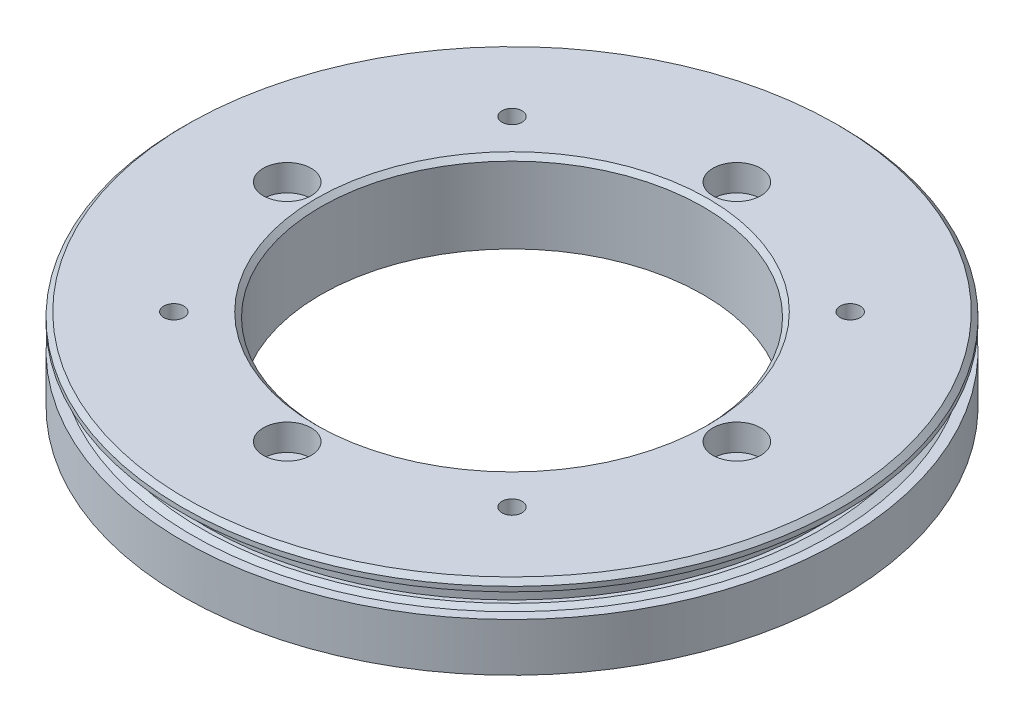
ISO-10303-21;
HEADER;
FILE_DESCRIPTION(('STEP AP214'),'2;1');
FILE_NAME('part.step','',(''),(''),'','','');
FILE_SCHEMA(('AUTOMOTIVE_DESIGN { 1 0 10303 214 1 1 1 1 }'));
ENDSEC;
DATA;
#1=APPLICATION_CONTEXT('core data for automotive mechanical design processes');
#2=APPLICATION_PROTOCOL_DEFINITION('international standard','automotive_design',2000,#1);
#3=PRODUCT_CONTEXT('',#1,'mechanical');
#4=PRODUCT('Part','Part','',(#3));
#5=PRODUCT_RELATED_PRODUCT_CATEGORY('part','',(#4));
#6=PRODUCT_DEFINITION_FORMATION('','',#4);
#7=PRODUCT_DEFINITION_CONTEXT('part definition',#1,'design');
#8=PRODUCT_DEFINITION('design','',#6,#7);
#9=PRODUCT_DEFINITION_SHAPE('','',#8);
#10=(LENGTH_UNIT() NAMED_UNIT(*) SI_UNIT(.MILLI.,.METRE.));
#11=(NAMED_UNIT(*) PLANE_ANGLE_UNIT() SI_UNIT($,.RADIAN.));
#12=(NAMED_UNIT(*) SI_UNIT($,.STERADIAN.) SOLID_ANGLE_UNIT());
#13=UNCERTAINTY_MEASURE_WITH_UNIT(LENGTH_MEASURE(1.E-05),#10,'distance_accuracy_value','');
#14=(GEOMETRIC_REPRESENTATION_CONTEXT(3) GLOBAL_UNCERTAINTY_ASSIGNED_CONTEXT((#13)) GLOBAL_UNIT_ASSIGNED_CONTEXT((#10,
#11,#12)) REPRESENTATION_CONTEXT('',''));
#15=CARTESIAN_POINT('',(0.,0.,0.));
#16=DIRECTION('',(0.,0.,1.));
#17=DIRECTION('',(1.,0.,0.));
#18=AXIS2_PLACEMENT_3D('',#15,#16,#17);
#19=CARTESIAN_POINT('',(-68.9,12.1,-2.00000000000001));
#20=DIRECTION('',(-1.,0.,0.));
#21=DIRECTION('',(0.,-1.,0.));
#22=AXIS2_PLACEMENT_3D('',#19,#20,#21);
#23=CYLINDRICAL_SURFACE('',#22,3.);
#24=CARTESIAN_POINT('',(-66.8700979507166,9.1,-2.00000001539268));
#25=CARTESIAN_POINT('',(-66.8675752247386,9.09999179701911,-2.08439950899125));
#26=CARTESIAN_POINT('',(-66.8648897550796,9.10356155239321,-2.16879019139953));
#27=CARTESIAN_POINT('',(-66.8592225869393,9.11779165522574,-2.33695928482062));
#28=CARTESIAN_POINT('',(-66.8562408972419,9.12845179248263,-2.42073771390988));
#29=CARTESIAN_POINT('',(-66.8500103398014,9.15679759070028,-2.58709418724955));
#30=CARTESIAN_POINT('',(-66.846761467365,9.17448337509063,-2.66967221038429));
#31=CARTESIAN_POINT('',(-66.8400383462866,9.21673584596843,-2.83301400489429));
#32=CARTESIAN_POINT('',(-66.8365641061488,9.24130227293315,-2.91377784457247));
#33=CARTESIAN_POINT('',(-66.8258665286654,9.32512241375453,-3.15259508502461));
#34=CARTESIAN_POINT('',(-66.8183670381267,9.3945028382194,-3.30720833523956));
#35=CARTESIAN_POINT('',(-66.8031065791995,9.55815899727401,-3.60233496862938));
#36=CARTESIAN_POINT('',(-66.7953459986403,9.65239911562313,-3.74286812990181));
#37=CARTESIAN_POINT('',(-66.7839488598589,9.80961101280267,-3.93934401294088));
#38=CARTESIAN_POINT('',(-66.780213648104,9.86425656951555,-4.0020907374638));
#39=CARTESIAN_POINT('',(-66.7728724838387,9.97849500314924,-4.12275909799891));
#40=CARTESIAN_POINT('',(-66.7692663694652,10.0380813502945,-4.18068690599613));
#41=CARTESIAN_POINT('',(-66.7657526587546,10.1,-4.23606797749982));
#42=B_SPLINE_CURVE_WITH_KNOTS('',3,(#24,#25,#26,#27,#28,#29,#30,#31,#32,#33,#34,#35,#36,#37,#38,
#39,#40,#41),.UNSPECIFIED.,.F.,.F.,(4,2,2,2,2,2,2,2,4),(0.,0.253228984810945,0.506450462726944,
0.759676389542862,1.01289276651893,1.51922289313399,2.02483150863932,2.27445127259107,
2.52374624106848),.UNSPECIFIED.);
#43=CARTESIAN_POINT('',(-66.8700979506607,9.10000000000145,-2.00000001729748));
#44=VERTEX_POINT('',#43);
#45=CARTESIAN_POINT('',(-66.7657526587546,10.1,-4.23606797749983));
#46=VERTEX_POINT('',#45);
#47=EDGE_CURVE('E142',#44,#46,#42,.T.);
#48=ORIENTED_EDGE('',*,*,#47,.T.);
#49=DIRECTION('',(1.,0.,0.));
#50=VECTOR('',#49,1.);
#51=CARTESIAN_POINT('',(0.,10.1,-4.23606797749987));
#52=LINE('',#51,#50);
#53=CARTESIAN_POINT('',(-68.7696570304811,10.1,-4.23606797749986));
#54=VERTEX_POINT('',#53);
#55=EDGE_CURVE('E138',#46,#54,#52,.F.);
#56=ORIENTED_EDGE('',*,*,#55,.T.);
#57=CARTESIAN_POINT('',(-68.8709663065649,9.1,-1.99999999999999));
#58=CARTESIAN_POINT('',(-68.8685169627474,9.0999917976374,-2.08439635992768));
#59=CARTESIAN_POINT('',(-68.86590961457,9.10356128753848,-2.16878420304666));
#60=CARTESIAN_POINT('',(-68.8604073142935,9.11779048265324,-2.33694828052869));
#61=CARTESIAN_POINT('',(-68.8575123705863,9.12844998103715,-2.420724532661));
#62=CARTESIAN_POINT('',(-68.8514630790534,9.15679430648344,-2.58707746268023));
#63=CARTESIAN_POINT('',(-68.8483087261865,9.17447927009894,-2.66965411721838));
#64=CARTESIAN_POINT('',(-68.8417812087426,9.21673003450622,-2.83299376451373));
#65=CARTESIAN_POINT('',(-68.8384080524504,9.2412955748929,-2.91375682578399));
#66=CARTESIAN_POINT('',(-68.8280217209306,9.32511327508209,-3.1525729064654));
#67=CARTESIAN_POINT('',(-68.820740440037,9.39449229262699,-3.30718653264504));
#68=CARTESIAN_POINT('',(-68.8059241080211,9.5581461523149,-3.60231458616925));
#69=CARTESIAN_POINT('',(-68.7983894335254,9.65238535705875,-3.74284880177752));
#70=CARTESIAN_POINT('',(-68.78732398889,9.80959832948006,-3.93932921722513));
#71=CARTESIAN_POINT('',(-68.783697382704,9.86424622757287,-4.00207935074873));
#72=CARTESIAN_POINT('',(-68.7765697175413,9.97848965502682,-4.12275391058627));
#73=CARTESIAN_POINT('',(-68.7730685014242,10.038078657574,-4.18068450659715));
#74=CARTESIAN_POINT('',(-68.7696570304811,10.1000000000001,-4.23606797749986));
#75=B_SPLINE_CURVE_WITH_KNOTS('',3,(#57,#58,#59,#60,#61,#62,#63,#64,#65,#66,#67,#68,#69,#70,#71,
#72,#73,#74),.UNSPECIFIED.,.F.,.F.,(4,2,2,2,2,2,2,2,4),(0.,0.253213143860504,0.506418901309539,
0.759629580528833,1.01283067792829,1.51913150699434,2.0247104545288,2.27432808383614,
2.52362108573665),.UNSPECIFIED.);
#76=CARTESIAN_POINT('',(-68.8709663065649,9.1,-1.99999999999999));
#77=VERTEX_POINT('',#76);
#78=EDGE_CURVE('E132',#77,#54,#75,.T.);
#79=ORIENTED_EDGE('',*,*,#78,.F.);
#80=DIRECTION('',(1.,0.,0.));
#81=VECTOR('',#80,1.);
#82=CARTESIAN_POINT('',(-68.9,9.1,-1.99999999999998));
#83=LINE('',#82,#81);
#84=EDGE_CURVE('E20',#77,#44,#83,.T.);
#85=ORIENTED_EDGE('',*,*,#84,.T.);
#86=EDGE_LOOP('',(#48,#56,#79,#85));
#87=FACE_BOUND('',#86,.T.);
#88=ADVANCED_FACE('F16',(#87),#23,.F.);
#89=CARTESIAN_POINT('',(-68.9,9.1,-1.99999999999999));
#90=DIRECTION('',(0.,-1.,0.));
#91=DIRECTION('',(0.,0.,-1.));
#92=AXIS2_PLACEMENT_3D('',#89,#90,#91);
#93=PLANE('',#92);
#94=DIRECTION('',(0.,0.,1.));
#95=VECTOR('',#94,1.);
#96=CARTESIAN_POINT('',(-65.9,9.1,0.));
#97=LINE('',#96,#95);
#98=CARTESIAN_POINT('',(-65.9000000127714,9.1,-2.0000000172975));
#99=VERTEX_POINT('',#98);
#100=CARTESIAN_POINT('',(-65.9,9.1,1.99999995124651));
#101=VERTEX_POINT('',#100);
#102=EDGE_CURVE('E200',#99,#101,#97,.T.);
#103=ORIENTED_EDGE('',*,*,#102,.F.);
#104=DIRECTION('',(1.,0.,0.));
#105=VECTOR('',#104,1.);
#106=CARTESIAN_POINT('',(-68.9,9.1,-2.00000003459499));
#107=LINE('',#106,#105);
#108=EDGE_CURVE('E122',#99,#44,#107,.F.);
#109=ORIENTED_EDGE('',*,*,#108,.T.);
#110=ORIENTED_EDGE('',*,*,#84,.F.);
#111=CARTESIAN_POINT('',(0.,9.1,0.));
#112=DIRECTION('',(0.,-1.,0.));
#113=DIRECTION('',(0.,0.,-1.));
#114=AXIS2_PLACEMENT_3D('',#111,#112,#113);
#115=CIRCLE('',#114,68.9);
#116=CARTESIAN_POINT('',(-68.8709663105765,9.1,1.99999986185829));
#117=VERTEX_POINT('',#116);
#118=EDGE_CURVE('E121',#117,#77,#115,.T.);
#119=ORIENTED_EDGE('',*,*,#118,.F.);
#120=DIRECTION('',(1.,0.,0.));
#121=VECTOR('',#120,1.);
#122=CARTESIAN_POINT('',(-68.9,9.1,1.99999980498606));
#123=LINE('',#122,#121);
#124=CARTESIAN_POINT('',(-66.8700979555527,9.1000000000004,1.99999985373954));
#125=VERTEX_POINT('',#124);
#126=EDGE_CURVE('E164',#117,#125,#123,.T.);
#127=ORIENTED_EDGE('',*,*,#126,.T.);
#128=DIRECTION('',(1.,0.,0.));
#129=VECTOR('',#128,1.);
#130=CARTESIAN_POINT('',(-68.9,9.1,1.99999990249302));
#131=LINE('',#130,#129);
#132=EDGE_CURVE('E127',#101,#125,#131,.F.);
#133=ORIENTED_EDGE('',*,*,#132,.F.);
#134=EDGE_LOOP('',(#103,#109,#110,#119,#127,#133));
#135=FACE_BOUND('',#134,.T.);
#136=ADVANCED_FACE('F119',(#135),#93,.F.);
#137=CARTESIAN_POINT('',(-68.9,12.1,2.));
#138=DIRECTION('',(-1.,0.,0.));
#139=DIRECTION('',(0.,-1.,0.));
#140=AXIS2_PLACEMENT_3D('',#137,#138,#139);
#141=CYLINDRICAL_SURFACE('',#140,3.);
#142=ORIENTED_EDGE('',*,*,#126,.F.);
#143=CARTESIAN_POINT('',(-68.7696570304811,10.1000000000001,4.23606797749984));
#144=CARTESIAN_POINT('',(-68.7731236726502,10.0370711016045,4.179793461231));
#145=CARTESIAN_POINT('',(-68.7766845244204,9.97653427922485,4.12085613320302));
#146=CARTESIAN_POINT('',(-68.7839296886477,9.86064366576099,3.99809806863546));
#147=CARTESIAN_POINT('',(-68.7876139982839,9.80528975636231,3.9342774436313));
#148=CARTESIAN_POINT('',(-68.795041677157,9.70015537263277,3.80218539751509));
#149=CARTESIAN_POINT('',(-68.7987850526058,9.6503754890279,3.73391350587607));
#150=CARTESIAN_POINT('',(-68.806265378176,9.5567571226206,3.59343908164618));
#151=CARTESIAN_POINT('',(-68.810002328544,9.51291840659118,3.52123670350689));
#152=CARTESIAN_POINT('',(-68.8211156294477,9.39074125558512,3.29937627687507));
#153=CARTESIAN_POINT('',(-68.8283956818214,9.32172445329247,3.1444430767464));
#154=CARTESIAN_POINT('',(-68.8422303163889,9.21084106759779,2.82537581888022));
#155=CARTESIAN_POINT('',(-68.8487859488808,9.16893473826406,2.66125561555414));
#156=CARTESIAN_POINT('',(-68.8577780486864,9.12742038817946,2.41312023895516));
#157=CARTESIAN_POINT('',(-68.8606146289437,9.11713941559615,2.33078739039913));
#158=CARTESIAN_POINT('',(-68.8660060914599,9.10343331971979,2.16564952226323));
#159=CARTESIAN_POINT('',(-68.8685613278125,9.09999948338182,2.0828452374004));
#160=CARTESIAN_POINT('',(-68.870966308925,9.1,1.99999991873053));
#161=B_SPLINE_CURVE_WITH_KNOTS('',3,(#143,#144,#145,#146,#147,#148,#149,#150,#151,#152,#153,
#154,#155,#156,#157,#158,#159,#160),.UNSPECIFIED.,.F.,.F.,(4,2,2,2,2,2,2,2,4),(0.,
0.253393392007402,0.506780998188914,0.760195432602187,1.01359991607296,1.52032611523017,
2.02630772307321,2.27512130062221,2.52361805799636),.UNSPECIFIED.);
#162=CARTESIAN_POINT('',(-68.7696570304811,10.1,4.23606797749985));
#163=VERTEX_POINT('',#162);
#164=EDGE_CURVE('E135',#163,#117,#161,.T.);
#165=ORIENTED_EDGE('',*,*,#164,.F.);
#166=DIRECTION('',(1.,0.,0.));
#167=VECTOR('',#166,1.);
#168=CARTESIAN_POINT('',(0.,10.1,4.23606797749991));
#169=LINE('',#168,#167);
#170=CARTESIAN_POINT('',(-66.7657526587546,10.1000000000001,4.23606797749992));
#171=VERTEX_POINT('',#170);
#172=EDGE_CURVE('E213',#163,#171,#169,.T.);
#173=ORIENTED_EDGE('',*,*,#172,.T.);
#174=CARTESIAN_POINT('',(-66.7657526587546,10.1000000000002,4.23606797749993));
#175=CARTESIAN_POINT('',(-66.7693235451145,10.0370676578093,4.1797903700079));
#176=CARTESIAN_POINT('',(-66.7729914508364,9.97652782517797,4.12084983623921));
#177=CARTESIAN_POINT('',(-66.7804543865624,9.86063195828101,3.99808512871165));
#178=CARTESIAN_POINT('',(-66.7842494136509,9.80527580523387,3.93426106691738));
#179=CARTESIAN_POINT('',(-66.791900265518,9.70013741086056,3.80216167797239));
#180=CARTESIAN_POINT('',(-66.7957560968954,9.65035577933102,3.7338858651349));
#181=CARTESIAN_POINT('',(-66.8034610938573,9.5567345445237,3.59340326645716));
#182=CARTESIAN_POINT('',(-66.8073102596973,9.51289470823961,3.52119663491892));
#183=CARTESIAN_POINT('',(-66.8187572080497,9.39071510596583,3.29932287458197));
#184=CARTESIAN_POINT('',(-66.8262557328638,9.32169785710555,3.14437998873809));
#185=CARTESIAN_POINT('',(-66.8405053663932,9.21081643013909,2.82529149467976));
#186=CARTESIAN_POINT('',(-66.8472575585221,9.1689124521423,2.66115976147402));
#187=CARTESIAN_POINT('',(-66.8565182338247,9.12740839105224,2.41303011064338));
#188=CARTESIAN_POINT('',(-66.8594389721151,9.11713195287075,2.33071550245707));
#189=CARTESIAN_POINT('',(-66.864990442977,9.10343185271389,2.16561384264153));
#190=CARTESIAN_POINT('',(-66.8676215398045,9.09999948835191,2.08282752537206));
#191=CARTESIAN_POINT('',(-66.8700979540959,9.1,1.99999990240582));
#192=B_SPLINE_CURVE_WITH_KNOTS('',3,(#174,#175,#176,#177,#178,#179,#180,#181,#182,#183,#184,
#185,#186,#187,#188,#189,#190,#191),.UNSPECIFIED.,.F.,.F.,(4,2,2,2,2,2,2,2,4),(0.,
0.253420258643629,0.506834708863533,0.760276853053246,1.01370905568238,1.52049056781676,
2.02652647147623,2.27529302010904,2.52374305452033),.UNSPECIFIED.);
#193=EDGE_CURVE('E171',#171,#125,#192,.T.);
#194=ORIENTED_EDGE('',*,*,#193,.T.);
#195=EDGE_LOOP('',(#142,#165,#173,#194));
#196=FACE_BOUND('',#195,.T.);
#197=ADVANCED_FACE('F165',(#196),#141,.F.);
#198=CARTESIAN_POINT('',(0.,10.1,0.));
#199=DIRECTION('',(0.,-1.,0.));
#200=DIRECTION('',(0.,0.,-1.));
#201=AXIS2_PLACEMENT_3D('',#198,#199,#200);
#202=PLANE('',#201);
#203=ORIENTED_EDGE('',*,*,#55,.F.);
#204=CARTESIAN_POINT('',(0.,10.1,0.));
#205=DIRECTION('',(0.,-1.,0.));
#206=DIRECTION('',(0.,0.,-1.));
#207=AXIS2_PLACEMENT_3D('',#204,#205,#206);
#208=CIRCLE('',#207,66.9);
#209=EDGE_CURVE('E179',#46,#171,#208,.T.);
#210=ORIENTED_EDGE('',*,*,#209,.T.);
#211=ORIENTED_EDGE('',*,*,#172,.F.);
#212=CARTESIAN_POINT('',(0.,10.1,0.));
#213=DIRECTION('',(0.,-1.,0.));
#214=DIRECTION('',(0.,0.,-1.));
#215=AXIS2_PLACEMENT_3D('',#212,#213,#214);
#216=CIRCLE('',#215,68.9);
#217=EDGE_CURVE('E140',#54,#163,#216,.T.);
#218=ORIENTED_EDGE('',*,*,#217,.F.);
#219=EDGE_LOOP('',(#203,#210,#211,#218));
#220=FACE_BOUND('',#219,.T.);
#221=ADVANCED_FACE('F155',(#220),#202,.F.);
#222=CARTESIAN_POINT('',(0.,17.9550000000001,0.));
#223=DIRECTION('',(0.,-1.,0.));
#224=DIRECTION('',(0.,0.,-1.));
#225=AXIS2_PLACEMENT_3D('',#222,#223,#224);
#226=CYLINDRICAL_SURFACE('',#225,68.9);
#227=ORIENTED_EDGE('',*,*,#217,.T.);
#228=ORIENTED_EDGE('',*,*,#164,.T.);
#229=ORIENTED_EDGE('',*,*,#118,.T.);
#230=ORIENTED_EDGE('',*,*,#78,.T.);
#231=EDGE_LOOP('',(#227,#228,#229,#230));
#232=FACE_BOUND('',#231,.T.);
#233=CARTESIAN_POINT('',(0.,0.,0.));
#234=DIRECTION('',(0.,-1.,0.));
#235=DIRECTION('',(0.,0.,-1.));
#236=AXIS2_PLACEMENT_3D('',#233,#234,#235);
#237=CIRCLE('',#236,68.9);
#238=CARTESIAN_POINT('',(0.,0.,-68.9));
#239=VERTEX_POINT('',#238);
#240=EDGE_CURVE('E662',#239,#239,#237,.T.);
#241=ORIENTED_EDGE('',*,*,#240,.F.);
#242=EDGE_LOOP('',(#241));
#243=FACE_BOUND('',#242,.T.);
#244=ADVANCED_FACE('F130',(#232,#243),#226,.T.);
#245=CARTESIAN_POINT('',(-68.9,12.1,-2.00000000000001));
#246=DIRECTION('',(-1.,0.,0.));
#247=DIRECTION('',(0.,-1.,0.));
#248=AXIS2_PLACEMENT_3D('',#245,#246,#247);
#249=CYLINDRICAL_SURFACE('',#248,3.);
#250=CARTESIAN_POINT('',(-66.8700979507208,9.1,-2.0000000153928));
#251=CARTESIAN_POINT('',(-66.8689183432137,9.09999439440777,-2.03985220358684));
#252=CARTESIAN_POINT('',(-66.8659760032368,9.10079459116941,-2.07962546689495));
#253=CARTESIAN_POINT('',(-66.856724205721,9.10393901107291,-2.15866184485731));
#254=CARTESIAN_POINT('',(-66.8504194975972,9.10628105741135,-2.19792559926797));
#255=CARTESIAN_POINT('',(-66.8269681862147,9.11541250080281,-2.31320667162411));
#256=CARTESIAN_POINT('',(-66.8052293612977,9.12431266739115,-2.38815418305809));
#257=CARTESIAN_POINT('',(-66.7442196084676,9.14991366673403,-2.55291362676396));
#258=CARTESIAN_POINT('',(-66.7018057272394,9.16806878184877,-2.64130141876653));
#259=CARTESIAN_POINT('',(-66.6043602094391,9.21024557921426,-2.8105863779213));
#260=CARTESIAN_POINT('',(-66.5491755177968,9.23433867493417,-2.8913744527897));
#261=CARTESIAN_POINT('',(-66.4466018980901,9.27937490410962,-3.02347572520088));
#262=CARTESIAN_POINT('',(-66.4012691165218,9.29935030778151,-3.07676718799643));
#263=CARTESIAN_POINT('',(-66.3069910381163,9.34100991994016,-3.1794255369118));
#264=CARTESIAN_POINT('',(-66.2580423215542,9.36269574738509,-3.22878861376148));
#265=CARTESIAN_POINT('',(-66.1586694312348,9.40681448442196,-3.3226389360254));
#266=CARTESIAN_POINT('',(-66.1083177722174,9.42921281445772,-3.36722018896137));
#267=CARTESIAN_POINT('',(-66.0055830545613,9.4749889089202,-3.45315580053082));
#268=CARTESIAN_POINT('',(-65.9532052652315,9.49836414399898,-3.49451778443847));
#269=CARTESIAN_POINT('',(-65.9000001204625,9.5221406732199,-3.5344840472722));
#270=B_SPLINE_CURVE_WITH_KNOTS('',3,(#250,#251,#252,#253,#254,#255,#256,#257,#258,#259,#260,
#261,#262,#263,#264,#265,#266,#267,#268,#269),.UNSPECIFIED.,.F.,.F.,(4,2,2,2,2,2,2,2,2,4),(0.,
0.11951583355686,0.238863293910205,0.473300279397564,0.770795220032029,1.07205933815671,
1.2901210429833,1.50839168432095,1.72092973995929,1.93294799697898),.UNSPECIFIED.);
#271=CARTESIAN_POINT('',(-65.9000000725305,9.52214069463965,-3.53448408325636));
#272=VERTEX_POINT('',#271);
#273=EDGE_CURVE('E656',#44,#272,#270,.T.);
#274=ORIENTED_EDGE('',*,*,#273,.F.);
#275=ORIENTED_EDGE('',*,*,#108,.F.);
#276=CARTESIAN_POINT('',(-65.9000000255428,12.1,-2.00000000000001));
#277=DIRECTION('',(-1.,0.,0.));
#278=DIRECTION('',(0.,-1.,0.));
#279=AXIS2_PLACEMENT_3D('',#276,#277,#278);
#280=CIRCLE('',#279,3.);
#281=EDGE_CURVE('E198',#272,#99,#280,.T.);
#282=ORIENTED_EDGE('',*,*,#281,.F.);
#283=EDGE_LOOP('',(#274,#275,#282));
#284=FACE_BOUND('',#283,.T.);
#285=ADVANCED_FACE('F154',(#284),#249,.F.);
#286=CARTESIAN_POINT('',(-65.9,5.05,0.));
#287=DIRECTION('',(-1.,0.,0.));
#288=DIRECTION('',(0.,-1.,0.));
#289=AXIS2_PLACEMENT_3D('',#286,#287,#288);
#290=PLANE('',#289);
#291=ORIENTED_EDGE('',*,*,#281,.T.);
#292=ORIENTED_EDGE('',*,*,#102,.T.);
#293=CARTESIAN_POINT('',(-65.9,12.1,2.));
#294=DIRECTION('',(-1.,0.,0.));
#295=DIRECTION('',(0.,-1.,0.));
#296=AXIS2_PLACEMENT_3D('',#293,#294,#295);
#297=CIRCLE('',#296,3.);
#298=CARTESIAN_POINT('',(-65.9,9.52214071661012,3.53448405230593));
#299=VERTEX_POINT('',#298);
#300=EDGE_CURVE('E180',#101,#299,#297,.T.);
#301=ORIENTED_EDGE('',*,*,#300,.T.);
#302=CARTESIAN_POINT('',(-65.9000000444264,9.5221407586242,-3.53448400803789));
#303=CARTESIAN_POINT('',(-65.9000000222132,9.55158536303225,-2.3563226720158));
#304=CARTESIAN_POINT('',(-65.9000000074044,9.56630766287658,-1.17816133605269));
#305=CARTESIAN_POINT('',(-65.8999999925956,9.56630765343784,1.17816133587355));
#306=CARTESIAN_POINT('',(-65.8999999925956,9.55158534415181,2.35632267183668));
#307=CARTESIAN_POINT('',(-65.9,9.52214073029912,3.53448400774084));
#308=B_SPLINE_CURVE_WITH_KNOTS('',3,(#302,#303,#304,#305,#306,#307),.UNSPECIFIED.,.F.,.F.,(4,2,
4),(0.,3.53475995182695,7.06951990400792),.UNSPECIFIED.);
#309=EDGE_CURVE('E551',#272,#299,#308,.T.);
#310=ORIENTED_EDGE('',*,*,#309,.F.);
#311=EDGE_LOOP('',(#291,#292,#301,#310));
#312=FACE_BOUND('',#311,.T.);
#313=ADVANCED_FACE('F664',(#312),#290,.T.);
#314=CARTESIAN_POINT('',(-68.9,12.1,2.));
#315=DIRECTION('',(-1.,0.,0.));
#316=DIRECTION('',(0.,-1.,0.));
#317=AXIS2_PLACEMENT_3D('',#314,#315,#316);
#318=CYLINDRICAL_SURFACE('',#317,3.);
#319=CARTESIAN_POINT('',(-65.9000000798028,9.52214071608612,3.53448407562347));
#320=CARTESIAN_POINT('',(-65.9496060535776,9.49997253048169,3.49722579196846));
#321=CARTESIAN_POINT('',(-65.9984874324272,9.47815566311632,3.4587529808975));
#322=CARTESIAN_POINT('',(-66.0944986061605,9.43536615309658,3.37905400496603));
#323=CARTESIAN_POINT('',(-66.141625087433,9.41439510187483,3.33782300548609));
#324=CARTESIAN_POINT('',(-66.2347586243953,9.37302420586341,3.2513798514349));
#325=CARTESIAN_POINT('',(-66.2807107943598,9.35265055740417,3.20609538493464));
#326=CARTESIAN_POINT('',(-66.3696450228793,9.31331030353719,3.11218216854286));
#327=CARTESIAN_POINT('',(-66.4126290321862,9.29434277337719,3.06355565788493));
#328=CARTESIAN_POINT('',(-66.5154349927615,9.24911516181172,2.93750791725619));
#329=CARTESIAN_POINT('',(-66.5729893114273,9.22392416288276,2.85780098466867));
#330=CARTESIAN_POINT('',(-66.6758045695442,9.17926805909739,2.69043080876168));
#331=CARTESIAN_POINT('',(-66.7212042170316,9.15973811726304,2.6028740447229));
#332=CARTESIAN_POINT('',(-66.7748960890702,9.13702042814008,2.4715864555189));
#333=CARTESIAN_POINT('',(-66.7896768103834,9.13082753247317,2.43098397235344));
#334=CARTESIAN_POINT('',(-66.8158192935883,9.12002003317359,2.34849361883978));
#335=CARTESIAN_POINT('',(-66.8271827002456,9.11540467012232,2.30660637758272));
#336=CARTESIAN_POINT('',(-66.8463236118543,9.10783603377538,2.22098136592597));
#337=CARTESIAN_POINT('',(-66.8540252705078,9.10491765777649,2.17722335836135));
#338=CARTESIAN_POINT('',(-66.8652633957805,9.10099182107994,2.08900757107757));
#339=CARTESIAN_POINT('',(-66.8687916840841,9.09998811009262,2.04454858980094));
#340=CARTESIAN_POINT('',(-66.8700979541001,9.1,1.99999990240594));
#341=B_SPLINE_CURVE_WITH_KNOTS('',3,(#319,#320,#321,#322,#323,#324,#325,#326,#327,#328,#329,
#330,#331,#332,#333,#334,#335,#336,#337,#338,#339,#340),.UNSPECIFIED.,.F.,.F.,(4,2,2,2,2,2,2,2,
2,2,4),(0.,0.197661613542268,0.395679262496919,0.59850037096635,0.801186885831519,
1.10475446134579,1.40469381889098,1.53549623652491,1.66623559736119,1.79957624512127,
1.9331777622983),.UNSPECIFIED.);
#342=EDGE_CURVE('E557',#299,#125,#341,.T.);
#343=ORIENTED_EDGE('',*,*,#342,.F.);
#344=ORIENTED_EDGE('',*,*,#300,.F.);
#345=ORIENTED_EDGE('',*,*,#132,.T.);
#346=EDGE_LOOP('',(#343,#344,#345));
#347=FACE_BOUND('',#346,.T.);
#348=ADVANCED_FACE('F189',(#347),#318,.F.);
#349=CARTESIAN_POINT('',(0.,17.9550000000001,0.));
#350=DIRECTION('',(0.,-1.,0.));
#351=DIRECTION('',(0.,0.,-1.));
#352=AXIS2_PLACEMENT_3D('',#349,#350,#351);
#353=CYLINDRICAL_SURFACE('',#352,66.9);
#354=ORIENTED_EDGE('',*,*,#209,.F.);
#355=ORIENTED_EDGE('',*,*,#47,.F.);
#356=CARTESIAN_POINT('',(0.,9.10000000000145,0.));
#357=DIRECTION('',(0.,-1.,0.));
#358=DIRECTION('',(0.,0.,-1.));
#359=AXIS2_PLACEMENT_3D('',#356,#357,#358);
#360=CIRCLE('',#359,66.9000000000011);
#361=EDGE_CURVE('E563',#125,#44,#360,.F.);
#362=ORIENTED_EDGE('',*,*,#361,.F.);
#363=ORIENTED_EDGE('',*,*,#193,.F.);
#364=EDGE_LOOP('',(#354,#355,#362,#363));
#365=FACE_BOUND('',#364,.T.);
#366=ADVANCED_FACE('F183',(#365),#353,.F.);
#367=CARTESIAN_POINT('',(0.,0.,0.));
#368=DIRECTION('',(0.,-1.,0.));
#369=DIRECTION('',(0.,0.,-1.));
#370=AXIS2_PLACEMENT_3D('',#367,#368,#369);
#371=PLANE('',#370);
#372=ORIENTED_EDGE('',*,*,#240,.T.);
#373=EDGE_LOOP('',(#372));
#374=FACE_BOUND('',#373,.T.);
#375=CARTESIAN_POINT('',(0.,-1.11022302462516E-13,0.));
#376=DIRECTION('',(0.,-1.,0.));
#377=DIRECTION('',(0.,0.,-1.));
#378=AXIS2_PLACEMENT_3D('',#375,#376,#377);
#379=CIRCLE('',#378,65.9999999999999);
#380=CARTESIAN_POINT('',(0.,-1.11022302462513E-13,-65.9999999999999));
#381=VERTEX_POINT('',#380);
#382=EDGE_CURVE('E564',#381,#381,#379,.F.);
#383=ORIENTED_EDGE('',*,*,#382,.T.);
#384=EDGE_LOOP('',(#383));
#385=FACE_BOUND('',#384,.T.);
#386=ADVANCED_FACE('F188',(#374,#385),#371,.T.);
#387=CARTESIAN_POINT('',(0.,9.10000000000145,0.));
#388=DIRECTION('',(0.,-1.,0.));
#389=DIRECTION('',(0.,0.,-1.));
#390=AXIS2_PLACEMENT_3D('',#387,#388,#389);
#391=CONICAL_SURFACE('',#390,66.9000000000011,1.1344640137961);
#392=ORIENTED_EDGE('',*,*,#342,.T.);
#393=ORIENTED_EDGE('',*,*,#361,.T.);
#394=ORIENTED_EDGE('',*,*,#273,.T.);
#395=ORIENTED_EDGE('',*,*,#309,.T.);
#396=EDGE_LOOP('',(#392,#393,#394,#395));
#397=FACE_BOUND('',#396,.T.);
#398=CARTESIAN_POINT('',(0.,10.1000000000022,0.));
#399=DIRECTION('',(0.,-1.,0.));
#400=DIRECTION('',(0.,0.,-1.));
#401=AXIS2_PLACEMENT_3D('',#398,#399,#400);
#402=CIRCLE('',#401,64.755493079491);
#403=CARTESIAN_POINT('',(0.,10.1000000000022,-64.755493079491));
#404=VERTEX_POINT('',#403);
#405=EDGE_CURVE('E567',#404,#404,#402,.T.);
#406=ORIENTED_EDGE('',*,*,#405,.T.);
#407=EDGE_LOOP('',(#406));
#408=FACE_BOUND('',#407,.T.);
#409=ADVANCED_FACE('F543',(#397,#408),#391,.T.);
#410=CARTESIAN_POINT('',(0.,-1.11022302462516E-13,0.));
#411=DIRECTION('',(0.,-1.,0.));
#412=DIRECTION('',(0.,0.,-1.));
#413=AXIS2_PLACEMENT_3D('',#410,#411,#412);
#414=CONICAL_SURFACE('',#413,65.9999999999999,0.7853981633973);
#415=ORIENTED_EDGE('',*,*,#382,.F.);
#416=EDGE_LOOP('',(#415));
#417=FACE_BOUND('',#416,.T.);
#418=CARTESIAN_POINT('',(0.,2.00000000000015,0.));
#419=DIRECTION('',(0.,-1.,0.));
#420=DIRECTION('',(0.,0.,-1.));
#421=AXIS2_PLACEMENT_3D('',#418,#419,#420);
#422=CIRCLE('',#421,64.0000000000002);
#423=CARTESIAN_POINT('',(0.,2.00000000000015,-64.0000000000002));
#424=VERTEX_POINT('',#423);
#425=EDGE_CURVE('E570',#424,#424,#422,.T.);
#426=ORIENTED_EDGE('',*,*,#425,.F.);
#427=EDGE_LOOP('',(#426));
#428=FACE_BOUND('',#427,.T.);
#429=ADVANCED_FACE('F539',(#417,#428),#414,.F.);
#430=CARTESIAN_POINT('',(0.,10.1,0.));
#431=DIRECTION('',(0.,-1.,0.));
#432=DIRECTION('',(0.,0.,-1.));
#433=AXIS2_PLACEMENT_3D('',#430,#431,#432);
#434=PLANE('',#433);
#435=ORIENTED_EDGE('',*,*,#405,.F.);
#436=EDGE_LOOP('',(#435));
#437=FACE_BOUND('',#436,.T.);
#438=CARTESIAN_POINT('',(0.,10.1,0.));
#439=DIRECTION('',(0.,-1.,0.));
#440=DIRECTION('',(0.,0.,-1.));
#441=AXIS2_PLACEMENT_3D('',#438,#439,#440);
#442=CIRCLE('',#441,63.9);
#443=CARTESIAN_POINT('',(0.,10.1,-63.9));
#444=VERTEX_POINT('',#443);
#445=EDGE_CURVE('E573',#444,#444,#442,.F.);
#446=ORIENTED_EDGE('',*,*,#445,.F.);
#447=EDGE_LOOP('',(#446));
#448=FACE_BOUND('',#447,.T.);
#449=ADVANCED_FACE('F535',(#437,#448),#434,.F.);
#450=CARTESIAN_POINT('',(0.,2.,0.));
#451=DIRECTION('',(0.,-1.,0.));
#452=DIRECTION('',(0.,0.,-1.));
#453=AXIS2_PLACEMENT_3D('',#450,#451,#452);
#454=PLANE('',#453);
#455=ORIENTED_EDGE('',*,*,#425,.T.);
#456=EDGE_LOOP('',(#455));
#457=FACE_BOUND('',#456,.T.);
#458=CARTESIAN_POINT('',(0.,2.00000000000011,0.));
#459=DIRECTION('',(0.,1.,0.));
#460=DIRECTION('',(0.,0.,1.));
#461=AXIS2_PLACEMENT_3D('',#458,#459,#460);
#462=CIRCLE('',#461,52.9999999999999);
#463=CARTESIAN_POINT('',(0.,2.00000000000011,52.9999999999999));
#464=VERTEX_POINT('',#463);
#465=EDGE_CURVE('E576',#464,#464,#462,.F.);
#466=ORIENTED_EDGE('',*,*,#465,.F.);
#467=EDGE_LOOP('',(#466));
#468=FACE_BOUND('',#467,.T.);
#469=ADVANCED_FACE('F531',(#457,#468),#454,.T.);
#470=CARTESIAN_POINT('',(0.,17.9550000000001,0.));
#471=DIRECTION('',(0.,-1.,0.));
#472=DIRECTION('',(0.,0.,-1.));
#473=AXIS2_PLACEMENT_3D('',#470,#471,#472);
#474=CYLINDRICAL_SURFACE('',#473,63.9);
#475=ORIENTED_EDGE('',*,*,#445,.T.);
#476=EDGE_LOOP('',(#475));
#477=FACE_BOUND('',#476,.T.);
#478=CARTESIAN_POINT('',(0.,15.1,0.));
#479=DIRECTION('',(0.,-1.,0.));
#480=DIRECTION('',(0.,0.,-1.));
#481=AXIS2_PLACEMENT_3D('',#478,#479,#480);
#482=CIRCLE('',#481,63.9);
#483=CARTESIAN_POINT('',(0.,15.1,-63.9));
#484=VERTEX_POINT('',#483);
#485=EDGE_CURVE('E579',#484,#484,#482,.F.);
#486=ORIENTED_EDGE('',*,*,#485,.F.);
#487=EDGE_LOOP('',(#486));
#488=FACE_BOUND('',#487,.T.);
#489=ADVANCED_FACE('F527',(#477,#488),#474,.T.);
#490=CARTESIAN_POINT('',(0.,2.00000000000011,0.));
#491=DIRECTION('',(0.,1.,0.));
#492=DIRECTION('',(0.,0.,1.));
#493=AXIS2_PLACEMENT_3D('',#490,#491,#492);
#494=CONICAL_SURFACE('',#493,52.9999999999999,0.7853981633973);
#495=ORIENTED_EDGE('',*,*,#465,.T.);
#496=EDGE_LOOP('',(#495));
#497=FACE_BOUND('',#496,.T.);
#498=CARTESIAN_POINT('',(0.,-1.45716771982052E-13,0.));
#499=DIRECTION('',(0.,1.,0.));
#500=DIRECTION('',(0.,0.,1.));
#501=AXIS2_PLACEMENT_3D('',#498,#499,#500);
#502=CIRCLE('',#501,51.0000000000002);
#503=CARTESIAN_POINT('',(0.,-1.45716771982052E-13,51.0000000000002));
#504=VERTEX_POINT('',#503);
#505=EDGE_CURVE('E594',#504,#504,#502,.F.);
#506=ORIENTED_EDGE('',*,*,#505,.F.);
#507=EDGE_LOOP('',(#506));
#508=FACE_BOUND('',#507,.T.);
#509=ADVANCED_FACE('F523',(#497,#508),#494,.T.);
#510=CARTESIAN_POINT('',(0.,15.1,0.));
#511=DIRECTION('',(0.,-1.,0.));
#512=DIRECTION('',(0.,0.,-1.));
#513=AXIS2_PLACEMENT_3D('',#510,#511,#512);
#514=PLANE('',#513);
#515=CARTESIAN_POINT('',(0.,15.0999999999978,0.));
#516=DIRECTION('',(0.,1.,0.));
#517=DIRECTION('',(0.,0.,1.));
#518=AXIS2_PLACEMENT_3D('',#515,#516,#517);
#519=CIRCLE('',#518,64.755493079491);
#520=CARTESIAN_POINT('',(0.,15.0999999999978,64.755493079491));
#521=VERTEX_POINT('',#520);
#522=EDGE_CURVE('E596',#521,#521,#519,.T.);
#523=ORIENTED_EDGE('',*,*,#522,.F.);
#524=EDGE_LOOP('',(#523));
#525=FACE_BOUND('',#524,.T.);
#526=ORIENTED_EDGE('',*,*,#485,.T.);
#527=EDGE_LOOP('',(#526));
#528=FACE_BOUND('',#527,.T.);
#529=ADVANCED_FACE('F519',(#525,#528),#514,.T.);
#530=CARTESIAN_POINT('',(-68.9,13.1,2.));
#531=DIRECTION('',(-1.,0.,0.));
#532=DIRECTION('',(0.,-1.,0.));
#533=AXIS2_PLACEMENT_3D('',#530,#531,#532);
#534=CYLINDRICAL_SURFACE('',#533,3.);
#535=CARTESIAN_POINT('',(-66.8700979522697,16.1,1.99999996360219));
#536=CARTESIAN_POINT('',(-66.868918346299,16.10000560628,2.03985215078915));
#537=CARTESIAN_POINT('',(-66.865976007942,16.0992054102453,2.07962541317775));
#538=CARTESIAN_POINT('',(-66.8567242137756,16.0960609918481,2.15866178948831));
#539=CARTESIAN_POINT('',(-66.8504195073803,16.0937189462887,2.1979255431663));
#540=CARTESIAN_POINT('',(-66.8269682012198,16.084587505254,2.31320661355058));
#541=CARTESIAN_POINT('',(-66.8052293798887,16.0756873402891,2.38815412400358));
#542=CARTESIAN_POINT('',(-66.7442196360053,16.0500863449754,2.55291356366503));
#543=CARTESIAN_POINT('',(-66.7018057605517,16.0319312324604,2.64130135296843));
#544=CARTESIAN_POINT('',(-66.6043602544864,15.9897544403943,2.81058630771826));
#545=CARTESIAN_POINT('',(-66.5491755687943,15.9656613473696,2.89137438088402));
#546=CARTESIAN_POINT('',(-66.4466019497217,15.9206251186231,3.02347566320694));
#547=CARTESIAN_POINT('',(-66.4012691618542,15.9006497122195,3.07676713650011));
#548=CARTESIAN_POINT('',(-66.3069910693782,15.8589900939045,3.17942550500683));
#549=CARTESIAN_POINT('',(-66.2580423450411,15.8373042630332,3.22878859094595));
#550=CARTESIAN_POINT('',(-66.1586694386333,15.7931855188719,3.32263892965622));
#551=CARTESIAN_POINT('',(-66.1083177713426,15.7707871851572,3.36722018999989));
#552=CARTESIAN_POINT('',(-66.0055830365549,15.7250110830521,3.45315581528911));
#553=CARTESIAN_POINT('',(-65.9532052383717,15.701635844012,3.49451780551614));
#554=CARTESIAN_POINT('',(-65.9000000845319,15.6778593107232,3.53448407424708));
#555=B_SPLINE_CURVE_WITH_KNOTS('',3,(#535,#536,#537,#538,#539,#540,#541,#542,#543,#544,#545,
#546,#547,#548,#549,#550,#551,#552,#553,#554),.UNSPECIFIED.,.F.,.F.,(4,2,2,2,2,2,2,2,2,4),(0.,
0.119515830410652,0.238863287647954,0.473300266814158,0.770795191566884,1.07205929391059,
1.29012103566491,1.50839171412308,1.720929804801,1.93294809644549),.UNSPECIFIED.);
#556=CARTESIAN_POINT('',(-66.8700979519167,16.1,1.99999997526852));
#557=VERTEX_POINT('',#556);
#558=CARTESIAN_POINT('',(-65.9000000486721,15.6778592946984,3.53448410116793));
#559=VERTEX_POINT('',#558);
#560=EDGE_CURVE('E446',#557,#559,#555,.T.);
#561=ORIENTED_EDGE('',*,*,#560,.F.);
#562=DIRECTION('',(-1.,0.,0.));
#563=VECTOR('',#562,1.);
#564=CARTESIAN_POINT('',(-68.9,16.1,2.));
#565=LINE('',#564,#563);
#566=CARTESIAN_POINT('',(-65.9000000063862,16.1,2.));
#567=VERTEX_POINT('',#566);
#568=EDGE_CURVE('E583',#567,#557,#565,.T.);
#569=ORIENTED_EDGE('',*,*,#568,.F.);
#570=CARTESIAN_POINT('',(-65.9000000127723,13.1,2.));
#571=DIRECTION('',(-1.,0.,0.));
#572=DIRECTION('',(0.,-1.,0.));
#573=AXIS2_PLACEMENT_3D('',#570,#571,#572);
#574=CIRCLE('',#573,3.);
#575=EDGE_CURVE('E584',#559,#567,#574,.T.);
#576=ORIENTED_EDGE('',*,*,#575,.F.);
#577=EDGE_LOOP('',(#561,#569,#576));
#578=FACE_BOUND('',#577,.T.);
#579=ADVANCED_FACE('F514',(#578),#534,.F.);
#580=CARTESIAN_POINT('',(-68.9,13.1,-2.00000000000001));
#581=DIRECTION('',(-1.,0.,0.));
#582=DIRECTION('',(0.,-1.,0.));
#583=AXIS2_PLACEMENT_3D('',#580,#581,#582);
#584=CYLINDRICAL_SURFACE('',#583,3.);
#585=CARTESIAN_POINT('',(-65.9000000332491,15.6778592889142,-3.53448411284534));
#586=CARTESIAN_POINT('',(-65.9496060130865,15.7000274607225,-3.49722582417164));
#587=CARTESIAN_POINT('',(-65.9984873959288,15.7218443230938,-3.4587530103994));
#588=CARTESIAN_POINT('',(-66.0944985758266,15.7646338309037,-3.37905403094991));
#589=CARTESIAN_POINT('',(-66.1416250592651,15.7856048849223,-3.33782303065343));
#590=CARTESIAN_POINT('',(-66.2347586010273,15.8269757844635,-3.25137987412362));
#591=CARTESIAN_POINT('',(-66.2807107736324,15.8473494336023,-3.20609540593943));
#592=CARTESIAN_POINT('',(-66.3696450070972,15.8866896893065,-3.11218218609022));
#593=CARTESIAN_POINT('',(-66.4126290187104,15.9056572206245,-3.06355567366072));
#594=CARTESIAN_POINT('',(-66.5154349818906,15.9508848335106,-2.93750793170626));
#595=CARTESIAN_POINT('',(-66.5729893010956,15.9760758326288,-2.85780099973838));
#596=CARTESIAN_POINT('',(-66.6758045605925,16.0207319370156,-2.69043082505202));
#597=CARTESIAN_POINT('',(-66.7212042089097,16.0402618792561,-2.60287406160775));
#598=CARTESIAN_POINT('',(-66.7748960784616,16.0629795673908,-2.47158648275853));
#599=CARTESIAN_POINT('',(-66.7896767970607,16.069172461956,-2.43098400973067));
#600=CARTESIAN_POINT('',(-66.8158192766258,16.0799799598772,-2.34849367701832));
#601=CARTESIAN_POINT('',(-66.8271826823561,16.0845953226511,-2.30660644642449));
#602=CARTESIAN_POINT('',(-66.8463235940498,16.0921639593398,-2.22098145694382));
#603=CARTESIAN_POINT('',(-66.8540252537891,16.0950823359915,-2.17722346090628));
#604=CARTESIAN_POINT('',(-66.8652633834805,16.0990081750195,-2.08900769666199));
#605=CARTESIAN_POINT('',(-66.8687916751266,16.1000118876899,-2.04454872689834));
#606=CARTESIAN_POINT('',(-66.8700979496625,16.1,-2.00000005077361));
#607=B_SPLINE_CURVE_WITH_KNOTS('',3,(#585,#586,#587,#588,#589,#590,#591,#592,#593,#594,#595,
#596,#597,#598,#599,#600,#601,#602,#603,#604,#605,#606),.UNSPECIFIED.,.F.,.F.,(4,2,2,2,2,2,2,2,
2,2,4),(0.,0.197661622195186,0.395679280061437,0.598500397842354,0.801186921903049,
1.10475449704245,1.40469385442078,1.53549624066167,1.6662355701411,1.79957618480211,
1.9331776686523),.UNSPECIFIED.);
#608=CARTESIAN_POINT('',(-65.9000000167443,15.6778592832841,-3.53448412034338));
#609=VERTEX_POINT('',#608);
#610=CARTESIAN_POINT('',(-66.8700979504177,16.1,-2.00000002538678));
#611=VERTEX_POINT('',#610);
#612=EDGE_CURVE('E503',#609,#611,#607,.T.);
#613=ORIENTED_EDGE('',*,*,#612,.F.);
#614=CARTESIAN_POINT('',(-65.9,13.1,-2.00000000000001));
#615=DIRECTION('',(-1.,0.,0.));
#616=DIRECTION('',(0.,-1.,0.));
#617=AXIS2_PLACEMENT_3D('',#614,#615,#616);
#618=CIRCLE('',#617,3.);
#619=CARTESIAN_POINT('',(-65.9,16.1,-2.00000002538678));
#620=VERTEX_POINT('',#619);
#621=EDGE_CURVE('E587',#620,#609,#618,.T.);
#622=ORIENTED_EDGE('',*,*,#621,.F.);
#623=DIRECTION('',(-1.,0.,0.));
#624=VECTOR('',#623,1.);
#625=CARTESIAN_POINT('',(-68.9,16.1,-2.00000005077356));
#626=LINE('',#625,#624);
#627=EDGE_CURVE('E590',#611,#620,#626,.F.);
#628=ORIENTED_EDGE('',*,*,#627,.F.);
#629=EDGE_LOOP('',(#613,#622,#628));
#630=FACE_BOUND('',#629,.T.);
#631=ADVANCED_FACE('F510',(#630),#584,.F.);
#632=CARTESIAN_POINT('',(0.,0.,0.));
#633=DIRECTION('',(0.,-1.,0.));
#634=DIRECTION('',(0.,0.,-1.));
#635=AXIS2_PLACEMENT_3D('',#632,#633,#634);
#636=CONICAL_SURFACE('',#635,42.2,0.785398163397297);
#637=CARTESIAN_POINT('',(0.,0.,0.));
#638=DIRECTION('',(0.,-1.,0.));
#639=DIRECTION('',(0.,0.,-1.));
#640=AXIS2_PLACEMENT_3D('',#637,#638,#639);
#641=CIRCLE('',#640,42.2);
#642=CARTESIAN_POINT('',(0.,0.,-42.2));
#643=VERTEX_POINT('',#642);
#644=EDGE_CURVE('E591',#643,#643,#641,.F.);
#645=ORIENTED_EDGE('',*,*,#644,.F.);
#646=EDGE_LOOP('',(#645));
#647=FACE_BOUND('',#646,.T.);
#648=CARTESIAN_POINT('',(0.,0.200000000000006,0.));
#649=DIRECTION('',(0.,-1.,0.));
#650=DIRECTION('',(0.,0.,-1.));
#651=AXIS2_PLACEMENT_3D('',#648,#649,#650);
#652=CIRCLE('',#651,42.);
#653=CARTESIAN_POINT('',(0.,0.200000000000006,-42.));
#654=VERTEX_POINT('',#653);
#655=EDGE_CURVE('E490',#654,#654,#652,.T.);
#656=ORIENTED_EDGE('',*,*,#655,.F.);
#657=EDGE_LOOP('',(#656));
#658=FACE_BOUND('',#657,.T.);
#659=ADVANCED_FACE('F513',(#647,#658),#636,.F.);
#660=CARTESIAN_POINT('',(0.,0.,0.));
#661=DIRECTION('',(0.,-1.,0.));
#662=DIRECTION('',(0.,0.,-1.));
#663=AXIS2_PLACEMENT_3D('',#660,#661,#662);
#664=PLANE('',#663);
#665=ORIENTED_EDGE('',*,*,#505,.T.);
#666=EDGE_LOOP('',(#665));
#667=FACE_BOUND('',#666,.T.);
#668=CARTESIAN_POINT('',(0.,0.,-47.));
#669=DIRECTION('',(0.,1.,0.));
#670=DIRECTION('',(0.,0.,1.));
#671=AXIS2_PLACEMENT_3D('',#668,#669,#670);
#672=CIRCLE('',#671,2.75);
#673=CARTESIAN_POINT('',(0.,0.,-44.25));
#674=VERTEX_POINT('',#673);
#675=EDGE_CURVE('E461',#674,#674,#672,.T.);
#676=ORIENTED_EDGE('',*,*,#675,.T.);
#677=EDGE_LOOP('',(#676));
#678=FACE_BOUND('',#677,.T.);
#679=CARTESIAN_POINT('',(-47.,0.,0.));
#680=DIRECTION('',(0.,1.,0.));
#681=DIRECTION('',(0.,0.,1.));
#682=AXIS2_PLACEMENT_3D('',#679,#680,#681);
#683=CIRCLE('',#682,2.75);
#684=CARTESIAN_POINT('',(-47.,0.,2.75));
#685=VERTEX_POINT('',#684);
#686=EDGE_CURVE('E498',#685,#685,#683,.T.);
#687=ORIENTED_EDGE('',*,*,#686,.T.);
#688=EDGE_LOOP('',(#687));
#689=FACE_BOUND('',#688,.T.);
#690=CARTESIAN_POINT('',(0.,0.,47.));
#691=DIRECTION('',(0.,1.,0.));
#692=DIRECTION('',(0.,0.,1.));
#693=AXIS2_PLACEMENT_3D('',#690,#691,#692);
#694=CIRCLE('',#693,2.75);
#695=CARTESIAN_POINT('',(0.,0.,49.75));
#696=VERTEX_POINT('',#695);
#697=EDGE_CURVE('E494',#696,#696,#694,.T.);
#698=ORIENTED_EDGE('',*,*,#697,.T.);
#699=EDGE_LOOP('',(#698));
#700=FACE_BOUND('',#699,.T.);
#701=ORIENTED_EDGE('',*,*,#644,.T.);
#702=EDGE_LOOP('',(#701));
#703=FACE_BOUND('',#702,.T.);
#704=CARTESIAN_POINT('',(47.,0.,0.));
#705=DIRECTION('',(0.,1.,0.));
#706=DIRECTION('',(0.,0.,1.));
#707=AXIS2_PLACEMENT_3D('',#704,#705,#706);
#708=CIRCLE('',#707,2.75);
#709=CARTESIAN_POINT('',(47.,0.,2.75));
#710=VERTEX_POINT('',#709);
#711=EDGE_CURVE('E495',#710,#710,#708,.T.);
#712=ORIENTED_EDGE('',*,*,#711,.T.);
#713=EDGE_LOOP('',(#712));
#714=FACE_BOUND('',#713,.T.);
#715=ADVANCED_FACE('F440',(#667,#678,#689,#700,#703,#714),#664,.T.);
#716=CARTESIAN_POINT('',(0.,16.1,0.));
#717=DIRECTION('',(0.,1.,0.));
#718=DIRECTION('',(0.,0.,1.));
#719=AXIS2_PLACEMENT_3D('',#716,#717,#718);
#720=CONICAL_SURFACE('',#719,66.9000000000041,1.1344640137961);
#721=ORIENTED_EDGE('',*,*,#522,.T.);
#722=EDGE_LOOP('',(#721));
#723=FACE_BOUND('',#722,.T.);
#724=ORIENTED_EDGE('',*,*,#612,.T.);
#725=CARTESIAN_POINT('',(0.,16.1,0.));
#726=DIRECTION('',(0.,-1.,0.));
#727=DIRECTION('',(0.,0.,-1.));
#728=AXIS2_PLACEMENT_3D('',#725,#726,#727);
#729=CIRCLE('',#728,66.9);
#730=EDGE_CURVE('E501',#611,#557,#729,.T.);
#731=ORIENTED_EDGE('',*,*,#730,.T.);
#732=ORIENTED_EDGE('',*,*,#560,.T.);
#733=CARTESIAN_POINT('',(-65.9000000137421,15.677859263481,-3.53448410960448));
#734=CARTESIAN_POINT('',(-65.9000000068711,15.6484146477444,-2.35632274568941));
#735=CARTESIAN_POINT('',(-65.9000000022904,15.6336923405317,-1.17816138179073));
#736=CARTESIAN_POINT('',(-65.8999999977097,15.633692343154,1.17816134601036));
#737=CARTESIAN_POINT('',(-65.8999999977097,15.6484146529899,2.35632270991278));
#738=CARTESIAN_POINT('',(-65.9,15.6778592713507,3.5344840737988));
#739=B_SPLINE_CURVE_WITH_KNOTS('',3,(#733,#734,#735,#736,#737,#738),.UNSPECIFIED.,.F.,.F.,(4,2,
4),(0.,3.53476003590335,7.06952007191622),.UNSPECIFIED.);
#740=EDGE_CURVE('E453',#609,#559,#739,.T.);
#741=ORIENTED_EDGE('',*,*,#740,.F.);
#742=EDGE_LOOP('',(#724,#731,#732,#741));
#743=FACE_BOUND('',#742,.T.);
#744=ADVANCED_FACE('F433',(#723,#743),#720,.T.);
#745=CARTESIAN_POINT('',(0.,17.9550000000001,0.));
#746=DIRECTION('',(0.,-1.,0.));
#747=DIRECTION('',(0.,0.,-1.));
#748=AXIS2_PLACEMENT_3D('',#745,#746,#747);
#749=CYLINDRICAL_SURFACE('',#748,66.9);
#750=ORIENTED_EDGE('',*,*,#730,.F.);
#751=CARTESIAN_POINT('',(-66.8700979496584,16.1,-2.00000005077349));
#752=CARTESIAN_POINT('',(-66.8675752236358,16.1000082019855,-2.0843995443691));
#753=CARTESIAN_POINT('',(-66.8648897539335,16.0964384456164,-2.16879022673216));
#754=CARTESIAN_POINT('',(-66.8592225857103,16.0822083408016,-2.33695931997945));
#755=CARTESIAN_POINT('',(-66.8562408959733,16.0715482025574,-2.4207377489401));
#756=CARTESIAN_POINT('',(-66.8500103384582,16.0432024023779,-2.58709422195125));
#757=CARTESIAN_POINT('',(-66.8467614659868,16.025516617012,-2.66967224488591));
#758=CARTESIAN_POINT('',(-66.8400383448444,15.983264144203,-2.83301403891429));
#759=CARTESIAN_POINT('',(-66.8365641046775,15.9586977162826,-2.91377787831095));
#760=CARTESIAN_POINT('',(-66.8258665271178,15.8748775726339,-3.15259511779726));
#761=CARTESIAN_POINT('',(-66.8183670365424,15.8054971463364,-3.30720836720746));
#762=CARTESIAN_POINT('',(-66.803106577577,15.641840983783,-3.60233499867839));
#763=CARTESIAN_POINT('',(-66.7953459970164,15.5476008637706,-3.7428681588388));
#764=CARTESIAN_POINT('',(-66.7839488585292,15.3903889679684,-3.93934403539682));
#765=CARTESIAN_POINT('',(-66.7802136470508,15.3357434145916,-4.00209075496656));
#766=CARTESIAN_POINT('',(-66.7728724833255,15.2215049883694,-4.12275910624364));
#767=CARTESIAN_POINT('',(-66.7692663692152,15.1619186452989,-4.18068690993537));
#768=CARTESIAN_POINT('',(-66.7657526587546,15.1,-4.23606797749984));
#769=B_SPLINE_CURVE_WITH_KNOTS('',3,(#751,#752,#753,#754,#755,#756,#757,#758,#759,#760,#761,
#762,#763,#764,#765,#766,#767,#768),.UNSPECIFIED.,.F.,.F.,(4,2,2,2,2,2,2,2,4),(0.,
0.253228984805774,0.506450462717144,0.75967638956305,1.0128927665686,1.51922289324,
2.0248315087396,2.27445125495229,2.5237462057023),.UNSPECIFIED.);
#770=CARTESIAN_POINT('',(-66.7657526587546,15.1,-4.23606797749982));
#771=VERTEX_POINT('',#770);
#772=EDGE_CURVE('E422',#611,#771,#769,.T.);
#773=ORIENTED_EDGE('',*,*,#772,.T.);
#774=CARTESIAN_POINT('',(0.,15.1,0.));
#775=DIRECTION('',(0.,-1.,0.));
#776=DIRECTION('',(0.,0.,-1.));
#777=AXIS2_PLACEMENT_3D('',#774,#775,#776);
#778=CIRCLE('',#777,66.9);
#779=CARTESIAN_POINT('',(-66.7657526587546,15.0999999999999,4.2360679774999));
#780=VERTEX_POINT('',#779);
#781=EDGE_CURVE('E408',#780,#771,#778,.F.);
#782=ORIENTED_EDGE('',*,*,#781,.F.);
#783=CARTESIAN_POINT('',(-66.7657526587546,15.0999999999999,4.2360679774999));
#784=CARTESIAN_POINT('',(-66.7693235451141,15.1629323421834,4.17979037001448));
#785=CARTESIAN_POINT('',(-66.7729914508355,15.2234721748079,4.12084983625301));
#786=CARTESIAN_POINT('',(-66.7804543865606,15.3393680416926,3.99808512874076));
#787=CARTESIAN_POINT('',(-66.7842494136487,15.3947241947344,3.93426106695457));
#788=CARTESIAN_POINT('',(-66.7919002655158,15.4998625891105,3.80216167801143));
#789=CARTESIAN_POINT('',(-66.7957560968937,15.5496442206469,3.73388586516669));
#790=CARTESIAN_POINT('',(-66.8034610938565,15.6432654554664,3.59340326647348));
#791=CARTESIAN_POINT('',(-66.8073102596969,15.6871052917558,3.52119663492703));
#792=CARTESIAN_POINT('',(-66.8187572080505,15.8092848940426,3.29932287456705));
#793=CARTESIAN_POINT('',(-66.8262557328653,15.8783021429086,3.14437998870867));
#794=CARTESIAN_POINT('',(-66.8405053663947,15.98918356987,2.82529149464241));
#795=CARTESIAN_POINT('',(-66.8472575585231,16.0310875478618,2.66115976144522));
#796=CARTESIAN_POINT('',(-66.8565182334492,16.0725916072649,2.41303012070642));
#797=CARTESIAN_POINT('',(-66.8594389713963,16.0828680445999,2.33071552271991));
#798=CARTESIAN_POINT('',(-66.8649904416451,16.0965681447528,2.16561388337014));
#799=CARTESIAN_POINT('',(-66.8676215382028,16.1000005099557,2.0828275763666));
#800=CARTESIAN_POINT('',(-66.8700979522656,16.1,1.99999996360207));
#801=B_SPLINE_CURVE_WITH_KNOTS('',3,(#783,#784,#785,#786,#787,#788,#789,#790,#791,#792,#793,
#794,#795,#796,#797,#798,#799,#800),.UNSPECIFIED.,.F.,.F.,(4,2,2,2,2,2,2,2,4),(0.,
0.25342025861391,0.506834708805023,0.760276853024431,1.01370905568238,1.5204905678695,
2.02652647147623,2.27529298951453,2.52374299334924),.UNSPECIFIED.);
#802=EDGE_CURVE('E415',#780,#557,#801,.T.);
#803=ORIENTED_EDGE('',*,*,#802,.T.);
#804=EDGE_LOOP('',(#750,#773,#782,#803));
#805=FACE_BOUND('',#804,.T.);
#806=ADVANCED_FACE('F427',(#805),#749,.F.);
#807=CARTESIAN_POINT('',(47.,-0.854999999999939,0.));
#808=DIRECTION('',(0.,1.,0.));
#809=DIRECTION('',(0.,0.,1.));
#810=AXIS2_PLACEMENT_3D('',#807,#808,#809);
#811=CYLINDRICAL_SURFACE('',#810,2.75);
#812=ORIENTED_EDGE('',*,*,#711,.F.);
#813=EDGE_LOOP('',(#812));
#814=FACE_BOUND('',#813,.T.);
#815=CARTESIAN_POINT('',(47.,11.6000000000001,0.));
#816=DIRECTION('',(0.,1.,0.));
#817=DIRECTION('',(0.,0.,1.));
#818=AXIS2_PLACEMENT_3D('',#815,#816,#817);
#819=CIRCLE('',#818,2.75);
#820=CARTESIAN_POINT('',(47.,11.6000000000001,2.75));
#821=VERTEX_POINT('',#820);
#822=EDGE_CURVE('E399',#821,#821,#819,.F.);
#823=ORIENTED_EDGE('',*,*,#822,.F.);
#824=EDGE_LOOP('',(#823));
#825=FACE_BOUND('',#824,.T.);
#826=ADVANCED_FACE('F432',(#814,#825),#811,.F.);
#827=CARTESIAN_POINT('',(0.,0.199999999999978,0.));
#828=DIRECTION('',(0.,-1.,0.));
#829=DIRECTION('',(0.,0.,-1.));
#830=AXIS2_PLACEMENT_3D('',#827,#828,#829);
#831=PLANE('',#830);
#832=ORIENTED_EDGE('',*,*,#655,.T.);
#833=EDGE_LOOP('',(#832));
#834=FACE_BOUND('',#833,.T.);
#835=CARTESIAN_POINT('',(0.,0.199999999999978,0.));
#836=DIRECTION('',(0.,-1.,0.));
#837=DIRECTION('',(0.,0.,-1.));
#838=AXIS2_PLACEMENT_3D('',#835,#836,#837);
#839=CIRCLE('',#838,40.);
#840=CARTESIAN_POINT('',(0.,0.199999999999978,-40.));
#841=VERTEX_POINT('',#840);
#842=EDGE_CURVE('E401',#841,#841,#839,.F.);
#843=ORIENTED_EDGE('',*,*,#842,.T.);
#844=EDGE_LOOP('',(#843));
#845=FACE_BOUND('',#844,.T.);
#846=ADVANCED_FACE('F479',(#834,#845),#831,.T.);
#847=CARTESIAN_POINT('',(0.,-0.854999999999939,47.));
#848=DIRECTION('',(0.,1.,0.));
#849=DIRECTION('',(0.,0.,1.));
#850=AXIS2_PLACEMENT_3D('',#847,#848,#849);
#851=CYLINDRICAL_SURFACE('',#850,2.75);
#852=ORIENTED_EDGE('',*,*,#697,.F.);
#853=EDGE_LOOP('',(#852));
#854=FACE_BOUND('',#853,.T.);
#855=CARTESIAN_POINT('',(0.,11.6000000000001,47.));
#856=DIRECTION('',(0.,1.,0.));
#857=DIRECTION('',(0.,0.,1.));
#858=AXIS2_PLACEMENT_3D('',#855,#856,#857);
#859=CIRCLE('',#858,2.75);
#860=CARTESIAN_POINT('',(0.,11.6000000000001,49.75));
#861=VERTEX_POINT('',#860);
#862=EDGE_CURVE('E405',#861,#861,#859,.F.);
#863=ORIENTED_EDGE('',*,*,#862,.F.);
#864=EDGE_LOOP('',(#863));
#865=FACE_BOUND('',#864,.T.);
#866=ADVANCED_FACE('F476',(#854,#865),#851,.F.);
#867=CARTESIAN_POINT('',(-47.,-0.85500000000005,0.));
#868=DIRECTION('',(0.,1.,0.));
#869=DIRECTION('',(0.,0.,1.));
#870=AXIS2_PLACEMENT_3D('',#867,#868,#869);
#871=CYLINDRICAL_SURFACE('',#870,2.75);
#872=ORIENTED_EDGE('',*,*,#686,.F.);
#873=EDGE_LOOP('',(#872));
#874=FACE_BOUND('',#873,.T.);
#875=CARTESIAN_POINT('',(-47.,11.5999999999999,0.));
#876=DIRECTION('',(0.,1.,0.));
#877=DIRECTION('',(0.,0.,1.));
#878=AXIS2_PLACEMENT_3D('',#875,#876,#877);
#879=CIRCLE('',#878,2.75);
#880=CARTESIAN_POINT('',(-47.,11.5999999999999,2.75));
#881=VERTEX_POINT('',#880);
#882=EDGE_CURVE('E1037',#881,#881,#879,.F.);
#883=ORIENTED_EDGE('',*,*,#882,.F.);
#884=EDGE_LOOP('',(#883));
#885=FACE_BOUND('',#884,.T.);
#886=ADVANCED_FACE('F472',(#874,#885),#871,.F.);
#887=CARTESIAN_POINT('',(0.,-0.85500000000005,-47.));
#888=DIRECTION('',(0.,1.,0.));
#889=DIRECTION('',(0.,0.,1.));
#890=AXIS2_PLACEMENT_3D('',#887,#888,#889);
#891=CYLINDRICAL_SURFACE('',#890,2.75);
#892=ORIENTED_EDGE('',*,*,#675,.F.);
#893=EDGE_LOOP('',(#892));
#894=FACE_BOUND('',#893,.T.);
#895=CARTESIAN_POINT('',(0.,11.5999999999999,-47.));
#896=DIRECTION('',(0.,1.,0.));
#897=DIRECTION('',(0.,0.,1.));
#898=AXIS2_PLACEMENT_3D('',#895,#896,#897);
#899=CIRCLE('',#898,2.75);
#900=CARTESIAN_POINT('',(0.,11.5999999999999,-44.25));
#901=VERTEX_POINT('',#900);
#902=EDGE_CURVE('E1039',#901,#901,#899,.F.);
#903=ORIENTED_EDGE('',*,*,#902,.F.);
#904=EDGE_LOOP('',(#903));
#905=FACE_BOUND('',#904,.T.);
#906=ADVANCED_FACE('F467',(#894,#905),#891,.F.);
#907=CARTESIAN_POINT('',(-65.9,5.05,0.));
#908=DIRECTION('',(-1.,0.,0.));
#909=DIRECTION('',(0.,-1.,0.));
#910=AXIS2_PLACEMENT_3D('',#907,#908,#909);
#911=PLANE('',#910);
#912=DIRECTION('',(0.,0.,1.));
#913=VECTOR('',#912,1.);
#914=CARTESIAN_POINT('',(-65.9,16.1,2.));
#915=LINE('',#914,#913);
#916=EDGE_CURVE('E610',#567,#620,#915,.F.);
#917=ORIENTED_EDGE('',*,*,#916,.T.);
#918=ORIENTED_EDGE('',*,*,#621,.T.);
#919=ORIENTED_EDGE('',*,*,#740,.T.);
#920=ORIENTED_EDGE('',*,*,#575,.T.);
#921=EDGE_LOOP('',(#917,#918,#919,#920));
#922=FACE_BOUND('',#921,.T.);
#923=ADVANCED_FACE('F463',(#922),#911,.T.);
#924=CARTESIAN_POINT('',(-68.9,13.1,-2.00000000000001));
#925=DIRECTION('',(-1.,0.,0.));
#926=DIRECTION('',(0.,-1.,0.));
#927=AXIS2_PLACEMENT_3D('',#924,#925,#926);
#928=CYLINDRICAL_SURFACE('',#927,3.);
#929=CARTESIAN_POINT('',(-68.7696570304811,15.1,-4.23606797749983));
#930=CARTESIAN_POINT('',(-68.7731236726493,15.1629288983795,-4.17979346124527));
#931=CARTESIAN_POINT('',(-68.7766845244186,15.2234657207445,-4.12085613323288));
#932=CARTESIAN_POINT('',(-68.7839296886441,15.3393563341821,-3.99809806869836));
#933=CARTESIAN_POINT('',(-68.7876139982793,15.3947102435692,-3.93427744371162));
#934=CARTESIAN_POINT('',(-68.7950416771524,15.4998446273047,-3.80218539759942));
#935=CARTESIAN_POINT('',(-68.7987850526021,15.5496245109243,-3.73391350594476));
#936=CARTESIAN_POINT('',(-68.8062653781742,15.6432428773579,-3.59343908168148));
#937=CARTESIAN_POINT('',(-68.8100023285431,15.6870815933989,-3.52123670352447));
#938=CARTESIAN_POINT('',(-68.8211156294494,15.8092587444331,-3.29937627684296));
#939=CARTESIAN_POINT('',(-68.8283956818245,15.8782755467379,-3.14444307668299));
#940=CARTESIAN_POINT('',(-68.842230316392,15.9891589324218,-2.82537581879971));
#941=CARTESIAN_POINT('',(-68.8487859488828,16.0310652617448,-2.66125561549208));
#942=CARTESIAN_POINT('',(-68.8577780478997,16.0725796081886,-2.4131202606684));
#943=CARTESIAN_POINT('',(-68.8606146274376,16.0828605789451,-2.33078743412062));
#944=CARTESIAN_POINT('',(-68.8660060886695,16.0965666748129,-2.16564961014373));
#945=CARTESIAN_POINT('',(-68.8685613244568,16.1000005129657,-2.08284534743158));
#946=CARTESIAN_POINT('',(-68.8709663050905,16.1,-2.00000005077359));
#947=B_SPLINE_CURVE_WITH_KNOTS('',3,(#929,#930,#931,#932,#933,#934,#935,#936,#937,#938,#939,
#940,#941,#942,#943,#944,#945,#946),.UNSPECIFIED.,.F.,.F.,(4,2,2,2,2,2,2,2,4),(0.,
0.253393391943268,0.506780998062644,0.760195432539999,1.01359991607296,1.520326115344,
2.02630772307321,2.27512123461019,2.52361792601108),.UNSPECIFIED.);
#948=CARTESIAN_POINT('',(-68.7696570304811,15.1,-4.23606797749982));
#949=VERTEX_POINT('',#948);
#950=CARTESIAN_POINT('',(-68.8709663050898,16.1000000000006,-2.00000005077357));
#951=VERTEX_POINT('',#950);
#952=EDGE_CURVE('E276',#949,#951,#947,.T.);
#953=ORIENTED_EDGE('',*,*,#952,.F.);
#954=DIRECTION('',(1.,0.,0.));
#955=VECTOR('',#954,1.);
#956=CARTESIAN_POINT('',(0.,15.1,-4.23606797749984));
#957=LINE('',#956,#955);
#958=EDGE_CURVE('E402',#771,#949,#957,.F.);
#959=ORIENTED_EDGE('',*,*,#958,.F.);
#960=ORIENTED_EDGE('',*,*,#772,.F.);
#961=DIRECTION('',(1.,0.,0.));
#962=VECTOR('',#961,1.);
#963=CARTESIAN_POINT('',(-68.9,16.1,-2.00000005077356));
#964=LINE('',#963,#962);
#965=EDGE_CURVE('E275',#611,#951,#964,.F.);
#966=ORIENTED_EDGE('',*,*,#965,.T.);
#967=EDGE_LOOP('',(#953,#959,#960,#966));
#968=FACE_BOUND('',#967,.T.);
#969=ADVANCED_FACE('F339',(#968),#928,.F.);
#970=CARTESIAN_POINT('',(-68.9,13.1,2.));
#971=DIRECTION('',(-1.,0.,0.));
#972=DIRECTION('',(0.,-1.,0.));
#973=AXIS2_PLACEMENT_3D('',#970,#971,#972);
#974=CYLINDRICAL_SURFACE('',#973,3.);
#975=DIRECTION('',(1.,0.,0.));
#976=VECTOR('',#975,1.);
#977=CARTESIAN_POINT('',(-68.9,16.1,1.99999995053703));
#978=LINE('',#977,#976);
#979=CARTESIAN_POINT('',(-68.8709663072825,16.1000000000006,1.99999997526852));
#980=VERTEX_POINT('',#979);
#981=EDGE_CURVE('E628',#980,#557,#978,.T.);
#982=ORIENTED_EDGE('',*,*,#981,.T.);
#983=ORIENTED_EDGE('',*,*,#802,.F.);
#984=DIRECTION('',(1.,0.,0.));
#985=VECTOR('',#984,1.);
#986=CARTESIAN_POINT('',(0.,15.1,4.2360679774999));
#987=LINE('',#986,#985);
#988=CARTESIAN_POINT('',(-68.7696570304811,15.0999999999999,4.23606797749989));
#989=VERTEX_POINT('',#988);
#990=EDGE_CURVE('E414',#989,#780,#987,.T.);
#991=ORIENTED_EDGE('',*,*,#990,.F.);
#992=CARTESIAN_POINT('',(-68.8709663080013,16.1,1.99999995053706));
#993=CARTESIAN_POINT('',(-68.8685169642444,16.1000082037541,2.08439631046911));
#994=CARTESIAN_POINT('',(-68.8659096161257,16.096438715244,2.16878415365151));
#995=CARTESIAN_POINT('',(-68.8604073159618,16.0822095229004,2.33694823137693));
#996=CARTESIAN_POINT('',(-68.8575123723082,16.0715500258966,2.42072448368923));
#997=CARTESIAN_POINT('',(-68.8514630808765,16.0432057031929,2.58707741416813));
#998=CARTESIAN_POINT('',(-68.8483087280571,16.0255207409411,2.6696540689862));
#999=CARTESIAN_POINT('',(-68.8417812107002,15.9832699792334,2.83299371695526));
#1000=CARTESIAN_POINT('',(-68.8384080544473,15.9587044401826,2.91375677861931));
#1001=CARTESIAN_POINT('',(-68.8280217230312,15.8748867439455,3.15257286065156));
#1002=CARTESIAN_POINT('',(-68.8207404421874,15.8055077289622,3.30718648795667));
#1003=CARTESIAN_POINT('',(-68.8059241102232,15.6418538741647,3.6023145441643));
#1004=CARTESIAN_POINT('',(-68.7983894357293,15.5476146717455,3.74284876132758));
#1005=CARTESIAN_POINT('',(-68.7873239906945,15.3904016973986,3.93932918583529));
#1006=CARTESIAN_POINT('',(-68.7836973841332,15.3357537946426,4.00207932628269));
#1007=CARTESIAN_POINT('',(-68.7765697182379,15.2215103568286,4.12275389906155));
#1008=CARTESIAN_POINT('',(-68.7730685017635,15.1619213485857,4.1806845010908));
#1009=CARTESIAN_POINT('',(-68.7696570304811,15.0999999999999,4.23606797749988));
#1010=B_SPLINE_CURVE_WITH_KNOTS('',3,(#992,#993,#994,#995,#996,#997,#998,#999,#1000,#1001,#1002,
#1003,#1004,#1005,#1006,#1007,#1008,#1009),.UNSPECIFIED.,.F.,.F.,(4,2,2,2,2,2,2,2,4),(0.,
0.253213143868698,0.506418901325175,0.75962958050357,1.01283067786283,1.51913150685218,
2.02471045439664,2.2743281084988,2.5236211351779),.UNSPECIFIED.);
#1011=EDGE_CURVE('E267',#980,#989,#1010,.T.);
#1012=ORIENTED_EDGE('',*,*,#1011,.F.);
#1013=EDGE_LOOP('',(#982,#983,#991,#1012));
#1014=FACE_BOUND('',#1013,.T.);
#1015=ADVANCED_FACE('F282',(#1014),#974,.F.);
#1016=CARTESIAN_POINT('',(0.,15.1,0.));
#1017=DIRECTION('',(0.,-1.,0.));
#1018=DIRECTION('',(0.,0.,-1.));
#1019=AXIS2_PLACEMENT_3D('',#1016,#1017,#1018);
#1020=PLANE('',#1019);
#1021=ORIENTED_EDGE('',*,*,#958,.T.);
#1022=CARTESIAN_POINT('',(0.,15.1,0.));
#1023=DIRECTION('',(0.,-1.,0.));
#1024=DIRECTION('',(0.,0.,-1.));
#1025=AXIS2_PLACEMENT_3D('',#1022,#1023,#1024);
#1026=CIRCLE('',#1025,68.9);
#1027=EDGE_CURVE('E264',#989,#949,#1026,.F.);
#1028=ORIENTED_EDGE('',*,*,#1027,.F.);
#1029=ORIENTED_EDGE('',*,*,#990,.T.);
#1030=ORIENTED_EDGE('',*,*,#781,.T.);
#1031=EDGE_LOOP('',(#1021,#1028,#1029,#1030));
#1032=FACE_BOUND('',#1031,.T.);
#1033=ADVANCED_FACE('F331',(#1032),#1020,.T.);
#1034=CARTESIAN_POINT('',(-35.35533905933,4.59999999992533,-35.35533905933));
#1035=DIRECTION('',(0.,1.,0.));
#1036=DIRECTION('',(0.,0.,1.));
#1037=AXIS2_PLACEMENT_3D('',#1034,#1035,#1036);
#1038=CONICAL_SURFACE('',#1037,2.0999999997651,1.02974425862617);
#1039=CARTESIAN_POINT('',(-35.35533905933,3.3381927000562,-35.3553390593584));
#1040=VERTEX_POINT('',#1039);
#1041=VERTEX_LOOP('',#1040);
#1042=FACE_BOUND('',#1041,.T.);
#1043=CARTESIAN_POINT('',(-35.35533905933,4.59999999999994,-35.35533905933));
#1044=DIRECTION('',(0.,1.,0.));
#1045=DIRECTION('',(0.,0.,1.));
#1046=AXIS2_PLACEMENT_3D('',#1043,#1044,#1045);
#1047=CIRCLE('',#1046,2.1);
#1048=CARTESIAN_POINT('',(-35.35533905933,4.59999999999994,-33.25533905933));
#1049=VERTEX_POINT('',#1048);
#1050=EDGE_CURVE('E263',#1049,#1049,#1047,.T.);
#1051=ORIENTED_EDGE('',*,*,#1050,.T.);
#1052=EDGE_LOOP('',(#1051));
#1053=FACE_BOUND('',#1052,.T.);
#1054=ADVANCED_FACE('F328',(#1042,#1053),#1038,.F.);
#1055=CARTESIAN_POINT('',(47.,11.6000000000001,0.));
#1056=DIRECTION('',(0.,1.,0.));
#1057=DIRECTION('',(0.,0.,1.));
#1058=AXIS2_PLACEMENT_3D('',#1055,#1056,#1057);
#1059=PLANE('',#1058);
#1060=CARTESIAN_POINT('',(47.,11.6000000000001,0.));
#1061=DIRECTION('',(0.,1.,0.));
#1062=DIRECTION('',(0.,0.,1.));
#1063=AXIS2_PLACEMENT_3D('',#1060,#1061,#1062);
#1064=CIRCLE('',#1063,5.);
#1065=CARTESIAN_POINT('',(47.,11.6000000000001,5.));
#1066=VERTEX_POINT('',#1065);
#1067=EDGE_CURVE('E260',#1066,#1066,#1064,.T.);
#1068=ORIENTED_EDGE('',*,*,#1067,.T.);
#1069=EDGE_LOOP('',(#1068));
#1070=FACE_BOUND('',#1069,.T.);
#1071=ORIENTED_EDGE('',*,*,#822,.T.);
#1072=EDGE_LOOP('',(#1071));
#1073=FACE_BOUND('',#1072,.T.);
#1074=ADVANCED_FACE('F324',(#1070,#1073),#1059,.T.);
#1075=CARTESIAN_POINT('',(0.,17.9550000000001,0.));
#1076=DIRECTION('',(0.,-1.,0.));
#1077=DIRECTION('',(0.,0.,-1.));
#1078=AXIS2_PLACEMENT_3D('',#1075,#1076,#1077);
#1079=CYLINDRICAL_SURFACE('',#1078,40.);
#1080=CARTESIAN_POINT('',(0.,16.0999999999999,0.));
#1081=DIRECTION('',(0.,1.,0.));
#1082=DIRECTION('',(0.,0.,1.));
#1083=AXIS2_PLACEMENT_3D('',#1080,#1081,#1082);
#1084=CIRCLE('',#1083,40.);
#1085=CARTESIAN_POINT('',(0.,16.0999999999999,40.));
#1086=VERTEX_POINT('',#1085);
#1087=EDGE_CURVE('E259',#1086,#1086,#1084,.T.);
#1088=ORIENTED_EDGE('',*,*,#1087,.T.);
#1089=EDGE_LOOP('',(#1088));
#1090=FACE_BOUND('',#1089,.T.);
#1091=ORIENTED_EDGE('',*,*,#842,.F.);
#1092=EDGE_LOOP('',(#1091));
#1093=FACE_BOUND('',#1092,.T.);
#1094=ADVANCED_FACE('F320',(#1090,#1093),#1079,.F.);
#1095=CARTESIAN_POINT('',(0.,11.6000000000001,47.));
#1096=DIRECTION('',(0.,1.,0.));
#1097=DIRECTION('',(0.,0.,1.));
#1098=AXIS2_PLACEMENT_3D('',#1095,#1096,#1097);
#1099=PLANE('',#1098);
#1100=CARTESIAN_POINT('',(0.,11.6000000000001,47.));
#1101=DIRECTION('',(0.,1.,0.));
#1102=DIRECTION('',(0.,0.,1.));
#1103=AXIS2_PLACEMENT_3D('',#1100,#1101,#1102);
#1104=CIRCLE('',#1103,5.);
#1105=CARTESIAN_POINT('',(0.,11.6000000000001,52.));
#1106=VERTEX_POINT('',#1105);
#1107=EDGE_CURVE('E256',#1106,#1106,#1104,.T.);
#1108=ORIENTED_EDGE('',*,*,#1107,.T.);
#1109=EDGE_LOOP('',(#1108));
#1110=FACE_BOUND('',#1109,.T.);
#1111=ORIENTED_EDGE('',*,*,#862,.T.);
#1112=EDGE_LOOP('',(#1111));
#1113=FACE_BOUND('',#1112,.T.);
#1114=ADVANCED_FACE('F316',(#1110,#1113),#1099,.T.);
#1115=CARTESIAN_POINT('',(-47.,11.5999999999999,0.));
#1116=DIRECTION('',(0.,1.,0.));
#1117=DIRECTION('',(0.,0.,1.));
#1118=AXIS2_PLACEMENT_3D('',#1115,#1116,#1117);
#1119=PLANE('',#1118);
#1120=CARTESIAN_POINT('',(-47.,11.5999999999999,0.));
#1121=DIRECTION('',(0.,1.,0.));
#1122=DIRECTION('',(0.,0.,1.));
#1123=AXIS2_PLACEMENT_3D('',#1120,#1121,#1122);
#1124=CIRCLE('',#1123,5.);
#1125=CARTESIAN_POINT('',(-47.,11.5999999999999,5.));
#1126=VERTEX_POINT('',#1125);
#1127=EDGE_CURVE('E253',#1126,#1126,#1124,.T.);
#1128=ORIENTED_EDGE('',*,*,#1127,.T.);
#1129=EDGE_LOOP('',(#1128));
#1130=FACE_BOUND('',#1129,.T.);
#1131=ORIENTED_EDGE('',*,*,#882,.T.);
#1132=EDGE_LOOP('',(#1131));
#1133=FACE_BOUND('',#1132,.T.);
#1134=ADVANCED_FACE('F312',(#1130,#1133),#1119,.T.);
#1135=CARTESIAN_POINT('',(0.,11.5999999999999,-47.));
#1136=DIRECTION('',(0.,1.,0.));
#1137=DIRECTION('',(0.,0.,1.));
#1138=AXIS2_PLACEMENT_3D('',#1135,#1136,#1137);
#1139=PLANE('',#1138);
#1140=CARTESIAN_POINT('',(0.,11.5999999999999,-47.));
#1141=DIRECTION('',(0.,1.,0.));
#1142=DIRECTION('',(0.,0.,1.));
#1143=AXIS2_PLACEMENT_3D('',#1140,#1141,#1142);
#1144=CIRCLE('',#1143,5.);
#1145=CARTESIAN_POINT('',(0.,11.5999999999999,-42.));
#1146=VERTEX_POINT('',#1145);
#1147=EDGE_CURVE('E249',#1146,#1146,#1144,.T.);
#1148=ORIENTED_EDGE('',*,*,#1147,.T.);
#1149=EDGE_LOOP('',(#1148));
#1150=FACE_BOUND('',#1149,.T.);
#1151=ORIENTED_EDGE('',*,*,#902,.T.);
#1152=EDGE_LOOP('',(#1151));
#1153=FACE_BOUND('',#1152,.T.);
#1154=ADVANCED_FACE('F308',(#1150,#1153),#1139,.T.);
#1155=CARTESIAN_POINT('',(35.35533905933,4.59999999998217,-35.35533905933));
#1156=DIRECTION('',(0.,1.,0.));
#1157=DIRECTION('',(0.,0.,1.));
#1158=AXIS2_PLACEMENT_3D('',#1155,#1156,#1157);
#1159=CONICAL_SURFACE('',#1158,2.09999999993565,1.02974425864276);
#1160=CARTESIAN_POINT('',(35.35533905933,3.33819269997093,-35.35533905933));
#1161=VERTEX_POINT('',#1160);
#1162=VERTEX_LOOP('',#1161);
#1163=FACE_BOUND('',#1162,.T.);
#1164=CARTESIAN_POINT('',(35.35533905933,4.60000000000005,-35.35533905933));
#1165=DIRECTION('',(0.,1.,0.));
#1166=DIRECTION('',(0.,0.,1.));
#1167=AXIS2_PLACEMENT_3D('',#1164,#1165,#1166);
#1168=CIRCLE('',#1167,2.1);
#1169=CARTESIAN_POINT('',(35.35533905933,4.60000000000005,-33.25533905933));
#1170=VERTEX_POINT('',#1169);
#1171=EDGE_CURVE('E252',#1170,#1170,#1168,.T.);
#1172=ORIENTED_EDGE('',*,*,#1171,.T.);
#1173=EDGE_LOOP('',(#1172));
#1174=FACE_BOUND('',#1173,.T.);
#1175=ADVANCED_FACE('F304',(#1163,#1174),#1159,.F.);
#1176=CARTESIAN_POINT('',(35.35533905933,4.59999999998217,35.35533905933));
#1177=DIRECTION('',(0.,1.,0.));
#1178=DIRECTION('',(0.,0.,1.));
#1179=AXIS2_PLACEMENT_3D('',#1176,#1177,#1178);
#1180=CONICAL_SURFACE('',#1179,2.10000000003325,1.02974425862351);
#1181=CARTESIAN_POINT('',(35.35533905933,3.33819269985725,35.35533905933));
#1182=VERTEX_POINT('',#1181);
#1183=VERTEX_LOOP('',#1182);
#1184=FACE_BOUND('',#1183,.T.);
#1185=CARTESIAN_POINT('',(35.35533905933,4.60000000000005,35.35533905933));
#1186=DIRECTION('',(0.,1.,0.));
#1187=DIRECTION('',(0.,0.,1.));
#1188=AXIS2_PLACEMENT_3D('',#1185,#1186,#1187);
#1189=CIRCLE('',#1188,2.1);
#1190=CARTESIAN_POINT('',(35.35533905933,4.60000000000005,37.45533905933));
#1191=VERTEX_POINT('',#1190);
#1192=EDGE_CURVE('E638',#1191,#1191,#1189,.T.);
#1193=ORIENTED_EDGE('',*,*,#1192,.T.);
#1194=EDGE_LOOP('',(#1193));
#1195=FACE_BOUND('',#1194,.T.);
#1196=ADVANCED_FACE('F300',(#1184,#1195),#1180,.F.);
#1197=CARTESIAN_POINT('',(-35.35533905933,4.59999999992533,35.35533905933));
#1198=DIRECTION('',(0.,1.,0.));
#1199=DIRECTION('',(0.,0.,1.));
#1200=AXIS2_PLACEMENT_3D('',#1197,#1198,#1199);
#1201=CONICAL_SURFACE('',#1200,2.09999999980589,1.02974425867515);
#1202=CARTESIAN_POINT('',(-35.35533905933,3.33819270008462,35.35533905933));
#1203=VERTEX_POINT('',#1202);
#1204=VERTEX_LOOP('',#1203);
#1205=FACE_BOUND('',#1204,.T.);
#1206=CARTESIAN_POINT('',(-35.35533905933,4.60000000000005,35.35533905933));
#1207=DIRECTION('',(0.,1.,0.));
#1208=DIRECTION('',(0.,0.,1.));
#1209=AXIS2_PLACEMENT_3D('',#1206,#1207,#1208);
#1210=CIRCLE('',#1209,2.1);
#1211=CARTESIAN_POINT('',(-35.35533905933,4.60000000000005,37.45533905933));
#1212=VERTEX_POINT('',#1211);
#1213=EDGE_CURVE('E248',#1212,#1212,#1210,.T.);
#1214=ORIENTED_EDGE('',*,*,#1213,.T.);
#1215=EDGE_LOOP('',(#1214));
#1216=FACE_BOUND('',#1215,.T.);
#1217=ADVANCED_FACE('F296',(#1205,#1216),#1201,.F.);
#1218=CARTESIAN_POINT('',(-68.9,16.1,2.));
#1219=DIRECTION('',(0.,1.,0.));
#1220=DIRECTION('',(0.,0.,1.));
#1221=AXIS2_PLACEMENT_3D('',#1218,#1219,#1220);
#1222=PLANE('',#1221);
#1223=ORIENTED_EDGE('',*,*,#627,.T.);
#1224=ORIENTED_EDGE('',*,*,#916,.F.);
#1225=ORIENTED_EDGE('',*,*,#568,.T.);
#1226=ORIENTED_EDGE('',*,*,#981,.F.);
#1227=CARTESIAN_POINT('',(0.,16.1000000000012,0.));
#1228=DIRECTION('',(0.,-1.,0.));
#1229=DIRECTION('',(0.,0.,-1.));
#1230=AXIS2_PLACEMENT_3D('',#1227,#1228,#1229);
#1231=CIRCLE('',#1230,68.8999999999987);
#1232=EDGE_CURVE('E244',#951,#980,#1231,.F.);
#1233=ORIENTED_EDGE('',*,*,#1232,.F.);
#1234=ORIENTED_EDGE('',*,*,#965,.F.);
#1235=EDGE_LOOP('',(#1223,#1224,#1225,#1226,#1233,#1234));
#1236=FACE_BOUND('',#1235,.T.);
#1237=ADVANCED_FACE('F291',(#1236),#1222,.F.);
#1238=CARTESIAN_POINT('',(0.,17.9550000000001,0.));
#1239=DIRECTION('',(0.,-1.,0.));
#1240=DIRECTION('',(0.,0.,-1.));
#1241=AXIS2_PLACEMENT_3D('',#1238,#1239,#1240);
#1242=CYLINDRICAL_SURFACE('',#1241,68.9);
#1243=ORIENTED_EDGE('',*,*,#1027,.T.);
#1244=ORIENTED_EDGE('',*,*,#952,.T.);
#1245=CARTESIAN_POINT('',(0.,16.1000000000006,0.));
#1246=DIRECTION('',(0.,-1.,0.));
#1247=DIRECTION('',(0.,0.,-1.));
#1248=AXIS2_PLACEMENT_3D('',#1245,#1246,#1247);
#1249=CIRCLE('',#1248,68.8999999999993);
#1250=EDGE_CURVE('E39',#980,#951,#1249,.F.);
#1251=ORIENTED_EDGE('',*,*,#1250,.F.);
#1252=ORIENTED_EDGE('',*,*,#1011,.T.);
#1253=EDGE_LOOP('',(#1243,#1244,#1251,#1252));
#1254=FACE_BOUND('',#1253,.T.);
#1255=ADVANCED_FACE('F285',(#1254),#1242,.T.);
#1256=CARTESIAN_POINT('',(-35.35533905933,2.65010233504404,-35.35533905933));
#1257=DIRECTION('',(0.,1.,0.));
#1258=DIRECTION('',(0.,0.,1.));
#1259=AXIS2_PLACEMENT_3D('',#1256,#1257,#1258);
#1260=CYLINDRICAL_SURFACE('',#1259,2.1);
#1261=ORIENTED_EDGE('',*,*,#1050,.F.);
#1262=EDGE_LOOP('',(#1261));
#1263=FACE_BOUND('',#1262,.T.);
#1264=CARTESIAN_POINT('',(-35.35533905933,17.1,-35.35533905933));
#1265=DIRECTION('',(0.,1.,0.));
#1266=DIRECTION('',(0.,0.,1.));
#1267=AXIS2_PLACEMENT_3D('',#1264,#1265,#1266);
#1268=CIRCLE('',#1267,2.1);
#1269=CARTESIAN_POINT('',(-35.35533905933,17.1,-33.25533905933));
#1270=VERTEX_POINT('',#1269);
#1271=EDGE_CURVE('E240',#1270,#1270,#1268,.T.);
#1272=ORIENTED_EDGE('',*,*,#1271,.T.);
#1273=EDGE_LOOP('',(#1272));
#1274=FACE_BOUND('',#1273,.T.);
#1275=ADVANCED_FACE('F290',(#1263,#1274),#1260,.F.);
#1276=CARTESIAN_POINT('',(47.,-0.854999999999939,0.));
#1277=DIRECTION('',(0.,1.,0.));
#1278=DIRECTION('',(0.,0.,1.));
#1279=AXIS2_PLACEMENT_3D('',#1276,#1277,#1278);
#1280=CYLINDRICAL_SURFACE('',#1279,5.);
#1281=ORIENTED_EDGE('',*,*,#1067,.F.);
#1282=EDGE_LOOP('',(#1281));
#1283=FACE_BOUND('',#1282,.T.);
#1284=CARTESIAN_POINT('',(47.,17.1,0.));
#1285=DIRECTION('',(0.,1.,0.));
#1286=DIRECTION('',(0.,0.,1.));
#1287=AXIS2_PLACEMENT_3D('',#1284,#1285,#1286);
#1288=CIRCLE('',#1287,5.);
#1289=CARTESIAN_POINT('',(47.,17.1,5.));
#1290=VERTEX_POINT('',#1289);
#1291=EDGE_CURVE('E237',#1290,#1290,#1288,.T.);
#1292=ORIENTED_EDGE('',*,*,#1291,.T.);
#1293=EDGE_LOOP('',(#1292));
#1294=FACE_BOUND('',#1293,.T.);
#1295=ADVANCED_FACE('F381',(#1283,#1294),#1280,.F.);
#1296=CARTESIAN_POINT('',(0.,17.1000000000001,0.));
#1297=DIRECTION('',(0.,1.,0.));
#1298=DIRECTION('',(-1.,0.,0.));
#1299=AXIS2_PLACEMENT_3D('',#1296,#1297,#1298);
#1300=CONICAL_SURFACE('',#1299,40.9999999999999,0.785398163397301);
#1301=ORIENTED_EDGE('',*,*,#1087,.F.);
#1302=EDGE_LOOP('',(#1301));
#1303=FACE_BOUND('',#1302,.T.);
#1304=CARTESIAN_POINT('',(0.,17.1000000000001,0.));
#1305=DIRECTION('',(0.,1.,0.));
#1306=DIRECTION('',(-1.,0.,0.));
#1307=AXIS2_PLACEMENT_3D('',#1304,#1305,#1306);
#1308=CIRCLE('',#1307,40.9999999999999);
#1309=CARTESIAN_POINT('',(-40.9999999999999,17.1000000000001,0.));
#1310=VERTEX_POINT('',#1309);
#1311=EDGE_CURVE('E234',#1310,#1310,#1308,.T.);
#1312=ORIENTED_EDGE('',*,*,#1311,.T.);
#1313=EDGE_LOOP('',(#1312));
#1314=FACE_BOUND('',#1313,.T.);
#1315=ADVANCED_FACE('F378',(#1303,#1314),#1300,.F.);
#1316=CARTESIAN_POINT('',(0.,-0.854999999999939,47.));
#1317=DIRECTION('',(0.,1.,0.));
#1318=DIRECTION('',(0.,0.,1.));
#1319=AXIS2_PLACEMENT_3D('',#1316,#1317,#1318);
#1320=CYLINDRICAL_SURFACE('',#1319,5.);
#1321=ORIENTED_EDGE('',*,*,#1107,.F.);
#1322=EDGE_LOOP('',(#1321));
#1323=FACE_BOUND('',#1322,.T.);
#1324=CARTESIAN_POINT('',(0.,17.1,47.));
#1325=DIRECTION('',(0.,1.,0.));
#1326=DIRECTION('',(0.,0.,1.));
#1327=AXIS2_PLACEMENT_3D('',#1324,#1325,#1326);
#1328=CIRCLE('',#1327,5.);
#1329=CARTESIAN_POINT('',(0.,17.1,52.));
#1330=VERTEX_POINT('',#1329);
#1331=EDGE_CURVE('E231',#1330,#1330,#1328,.T.);
#1332=ORIENTED_EDGE('',*,*,#1331,.T.);
#1333=EDGE_LOOP('',(#1332));
#1334=FACE_BOUND('',#1333,.T.);
#1335=ADVANCED_FACE('F374',(#1323,#1334),#1320,.F.);
#1336=CARTESIAN_POINT('',(-47.,-0.85500000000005,0.));
#1337=DIRECTION('',(0.,1.,0.));
#1338=DIRECTION('',(0.,0.,1.));
#1339=AXIS2_PLACEMENT_3D('',#1336,#1337,#1338);
#1340=CYLINDRICAL_SURFACE('',#1339,5.);
#1341=ORIENTED_EDGE('',*,*,#1127,.F.);
#1342=EDGE_LOOP('',(#1341));
#1343=FACE_BOUND('',#1342,.T.);
#1344=CARTESIAN_POINT('',(-47.,17.1,0.));
#1345=DIRECTION('',(0.,1.,0.));
#1346=DIRECTION('',(0.,0.,1.));
#1347=AXIS2_PLACEMENT_3D('',#1344,#1345,#1346);
#1348=CIRCLE('',#1347,5.);
#1349=CARTESIAN_POINT('',(-47.,17.1,5.));
#1350=VERTEX_POINT('',#1349);
#1351=EDGE_CURVE('E228',#1350,#1350,#1348,.T.);
#1352=ORIENTED_EDGE('',*,*,#1351,.T.);
#1353=EDGE_LOOP('',(#1352));
#1354=FACE_BOUND('',#1353,.T.);
#1355=ADVANCED_FACE('F370',(#1343,#1354),#1340,.F.);
#1356=CARTESIAN_POINT('',(0.,-0.85500000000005,-47.));
#1357=DIRECTION('',(0.,1.,0.));
#1358=DIRECTION('',(0.,0.,1.));
#1359=AXIS2_PLACEMENT_3D('',#1356,#1357,#1358);
#1360=CYLINDRICAL_SURFACE('',#1359,5.);
#1361=ORIENTED_EDGE('',*,*,#1147,.F.);
#1362=EDGE_LOOP('',(#1361));
#1363=FACE_BOUND('',#1362,.T.);
#1364=CARTESIAN_POINT('',(0.,17.1,-47.));
#1365=DIRECTION('',(0.,1.,0.));
#1366=DIRECTION('',(0.,0.,1.));
#1367=AXIS2_PLACEMENT_3D('',#1364,#1365,#1366);
#1368=CIRCLE('',#1367,5.);
#1369=CARTESIAN_POINT('',(0.,17.1,-42.));
#1370=VERTEX_POINT('',#1369);
#1371=EDGE_CURVE('E224',#1370,#1370,#1368,.T.);
#1372=ORIENTED_EDGE('',*,*,#1371,.T.);
#1373=EDGE_LOOP('',(#1372));
#1374=FACE_BOUND('',#1373,.T.);
#1375=ADVANCED_FACE('F366',(#1363,#1374),#1360,.F.);
#1376=CARTESIAN_POINT('',(35.35533905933,2.65010233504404,-35.35533905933));
#1377=DIRECTION('',(0.,1.,0.));
#1378=DIRECTION('',(0.,0.,1.));
#1379=AXIS2_PLACEMENT_3D('',#1376,#1377,#1378);
#1380=CYLINDRICAL_SURFACE('',#1379,2.1);
#1381=ORIENTED_EDGE('',*,*,#1171,.F.);
#1382=EDGE_LOOP('',(#1381));
#1383=FACE_BOUND('',#1382,.T.);
#1384=CARTESIAN_POINT('',(35.35533905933,17.1,-35.35533905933));
#1385=DIRECTION('',(0.,1.,0.));
#1386=DIRECTION('',(0.,0.,1.));
#1387=AXIS2_PLACEMENT_3D('',#1384,#1385,#1386);
#1388=CIRCLE('',#1387,2.1);
#1389=CARTESIAN_POINT('',(35.35533905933,17.1,-33.25533905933));
#1390=VERTEX_POINT('',#1389);
#1391=EDGE_CURVE('E221',#1390,#1390,#1388,.T.);
#1392=ORIENTED_EDGE('',*,*,#1391,.T.);
#1393=EDGE_LOOP('',(#1392));
#1394=FACE_BOUND('',#1393,.T.);
#1395=ADVANCED_FACE('F362',(#1383,#1394),#1380,.F.);
#1396=CARTESIAN_POINT('',(35.35533905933,2.65010233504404,35.35533905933));
#1397=DIRECTION('',(0.,1.,0.));
#1398=DIRECTION('',(0.,0.,1.));
#1399=AXIS2_PLACEMENT_3D('',#1396,#1397,#1398);
#1400=CYLINDRICAL_SURFACE('',#1399,2.1);
#1401=ORIENTED_EDGE('',*,*,#1192,.F.);
#1402=EDGE_LOOP('',(#1401));
#1403=FACE_BOUND('',#1402,.T.);
#1404=CARTESIAN_POINT('',(35.35533905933,17.1,35.35533905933));
#1405=DIRECTION('',(0.,1.,0.));
#1406=DIRECTION('',(0.,0.,1.));
#1407=AXIS2_PLACEMENT_3D('',#1404,#1405,#1406);
#1408=CIRCLE('',#1407,2.1);
#1409=CARTESIAN_POINT('',(35.35533905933,17.1,37.45533905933));
#1410=VERTEX_POINT('',#1409);
#1411=EDGE_CURVE('E218',#1410,#1410,#1408,.T.);
#1412=ORIENTED_EDGE('',*,*,#1411,.T.);
#1413=EDGE_LOOP('',(#1412));
#1414=FACE_BOUND('',#1413,.T.);
#1415=ADVANCED_FACE('F358',(#1403,#1414),#1400,.F.);
#1416=CARTESIAN_POINT('',(-35.35533905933,2.65010233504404,35.35533905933));
#1417=DIRECTION('',(0.,1.,0.));
#1418=DIRECTION('',(0.,0.,1.));
#1419=AXIS2_PLACEMENT_3D('',#1416,#1417,#1418);
#1420=CYLINDRICAL_SURFACE('',#1419,2.1);
#1421=ORIENTED_EDGE('',*,*,#1213,.F.);
#1422=EDGE_LOOP('',(#1421));
#1423=FACE_BOUND('',#1422,.T.);
#1424=CARTESIAN_POINT('',(-35.35533905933,17.1,35.35533905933));
#1425=DIRECTION('',(0.,1.,0.));
#1426=DIRECTION('',(0.,0.,1.));
#1427=AXIS2_PLACEMENT_3D('',#1424,#1425,#1426);
#1428=CIRCLE('',#1427,2.1);
#1429=CARTESIAN_POINT('',(-35.35533905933,17.1,37.45533905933));
#1430=VERTEX_POINT('',#1429);
#1431=EDGE_CURVE('E27',#1430,#1430,#1428,.T.);
#1432=ORIENTED_EDGE('',*,*,#1431,.T.);
#1433=EDGE_LOOP('',(#1432));
#1434=FACE_BOUND('',#1433,.T.);
#1435=ADVANCED_FACE('F350',(#1423,#1434),#1420,.F.);
#1436=CARTESIAN_POINT('',(0.,16.1000000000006,0.));
#1437=DIRECTION('',(0.,-1.,0.));
#1438=DIRECTION('',(0.,0.,-1.));
#1439=AXIS2_PLACEMENT_3D('',#1436,#1437,#1438);
#1440=CONICAL_SURFACE('',#1439,68.8999999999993,0.785398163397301);
#1441=ORIENTED_EDGE('',*,*,#1232,.T.);
#1442=ORIENTED_EDGE('',*,*,#1250,.T.);
#1443=EDGE_LOOP('',(#1441,#1442));
#1444=FACE_BOUND('',#1443,.T.);
#1445=CARTESIAN_POINT('',(0.,17.1000000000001,0.));
#1446=DIRECTION('',(0.,-1.,0.));
#1447=DIRECTION('',(0.,0.,-1.));
#1448=AXIS2_PLACEMENT_3D('',#1445,#1446,#1447);
#1449=CIRCLE('',#1448,67.9);
#1450=CARTESIAN_POINT('',(0.,17.1000000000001,-67.9));
#1451=VERTEX_POINT('',#1450);
#1452=EDGE_CURVE('E11',#1451,#1451,#1449,.T.);
#1453=ORIENTED_EDGE('',*,*,#1452,.T.);
#1454=EDGE_LOOP('',(#1453));
#1455=FACE_BOUND('',#1454,.T.);
#1456=ADVANCED_FACE('F344',(#1444,#1455),#1440,.T.);
#1457=CARTESIAN_POINT('',(0.,17.1,0.));
#1458=DIRECTION('',(0.,-1.,0.));
#1459=DIRECTION('',(0.,0.,-1.));
#1460=AXIS2_PLACEMENT_3D('',#1457,#1458,#1459);
#1461=PLANE('',#1460);
#1462=ORIENTED_EDGE('',*,*,#1452,.F.);
#1463=EDGE_LOOP('',(#1462));
#1464=FACE_BOUND('',#1463,.T.);
#1465=ORIENTED_EDGE('',*,*,#1431,.F.);
#1466=EDGE_LOOP('',(#1465));
#1467=FACE_BOUND('',#1466,.T.);
#1468=ORIENTED_EDGE('',*,*,#1411,.F.);
#1469=EDGE_LOOP('',(#1468));
#1470=FACE_BOUND('',#1469,.T.);
#1471=ORIENTED_EDGE('',*,*,#1391,.F.);
#1472=EDGE_LOOP('',(#1471));
#1473=FACE_BOUND('',#1472,.T.);
#1474=ORIENTED_EDGE('',*,*,#1371,.F.);
#1475=EDGE_LOOP('',(#1474));
#1476=FACE_BOUND('',#1475,.T.);
#1477=ORIENTED_EDGE('',*,*,#1351,.F.);
#1478=EDGE_LOOP('',(#1477));
#1479=FACE_BOUND('',#1478,.T.);
#1480=ORIENTED_EDGE('',*,*,#1331,.F.);
#1481=EDGE_LOOP('',(#1480));
#1482=FACE_BOUND('',#1481,.T.);
#1483=ORIENTED_EDGE('',*,*,#1311,.F.);
#1484=EDGE_LOOP('',(#1483));
#1485=FACE_BOUND('',#1484,.T.);
#1486=ORIENTED_EDGE('',*,*,#1291,.F.);
#1487=EDGE_LOOP('',(#1486));
#1488=FACE_BOUND('',#1487,.T.);
#1489=ORIENTED_EDGE('',*,*,#1271,.F.);
#1490=EDGE_LOOP('',(#1489));
#1491=FACE_BOUND('',#1490,.T.);
#1492=ADVANCED_FACE('F342',(#1464,#1467,#1470,#1473,#1476,#1479,#1482,#1485,#1488,#1491),#1461,.F.);
#1493=CLOSED_SHELL('',(#88,#136,#197,#221,#244,#285,#313,#348,#366,#386,#409,#429,#449,#469,
#489,#509,#529,#579,#631,#659,#715,#744,#806,#826,#846,#866,#886,#906,#923,#969,#1015,#1033,
#1054,#1074,#1094,#1114,#1134,#1154,#1175,#1196,#1217,#1237,#1255,#1275,#1295,#1315,#1335,#1355,
#1375,#1395,#1415,#1435,#1456,#1492));
#1494=MANIFOLD_SOLID_BREP('B1',#1493);
#1495=ADVANCED_BREP_SHAPE_REPRESENTATION('',(#18,#1494),#14);
#1496=SHAPE_DEFINITION_REPRESENTATION(#9,#1495);
ENDSEC;
END-ISO-10303-21;
